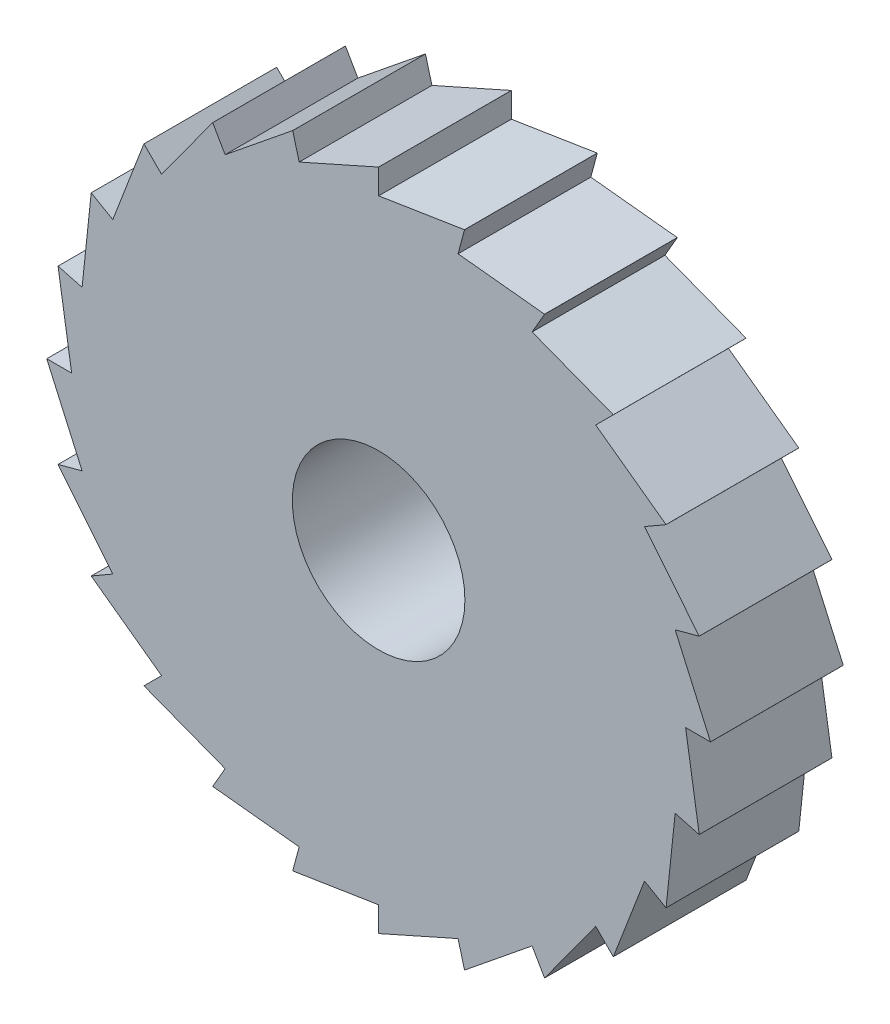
ISO-10303-21;
HEADER;
FILE_DESCRIPTION(('STEP AP214'),'2;1');
FILE_NAME('part.step','',(''),(''),'','','');
FILE_SCHEMA(('AUTOMOTIVE_DESIGN { 1 0 10303 214 1 1 1 1 }'));
ENDSEC;
DATA;
#1=APPLICATION_CONTEXT('core data for automotive mechanical design processes');
#2=APPLICATION_PROTOCOL_DEFINITION('international standard','automotive_design',2000,#1);
#3=PRODUCT_CONTEXT('',#1,'mechanical');
#4=PRODUCT('Part','Part','',(#3));
#5=PRODUCT_RELATED_PRODUCT_CATEGORY('part','',(#4));
#6=PRODUCT_DEFINITION_FORMATION('','',#4);
#7=PRODUCT_DEFINITION_CONTEXT('part definition',#1,'design');
#8=PRODUCT_DEFINITION('design','',#6,#7);
#9=PRODUCT_DEFINITION_SHAPE('','',#8);
#10=(LENGTH_UNIT() NAMED_UNIT(*) SI_UNIT(.MILLI.,.METRE.));
#11=(NAMED_UNIT(*) PLANE_ANGLE_UNIT() SI_UNIT($,.RADIAN.));
#12=(NAMED_UNIT(*) SI_UNIT($,.STERADIAN.) SOLID_ANGLE_UNIT());
#13=UNCERTAINTY_MEASURE_WITH_UNIT(LENGTH_MEASURE(1.E-05),#10,'distance_accuracy_value','');
#14=(GEOMETRIC_REPRESENTATION_CONTEXT(3) GLOBAL_UNCERTAINTY_ASSIGNED_CONTEXT((#13)) GLOBAL_UNIT_ASSIGNED_CONTEXT((#10,
#11,#12)) REPRESENTATION_CONTEXT('',''));
#15=CARTESIAN_POINT('',(0.,0.,0.));
#16=DIRECTION('',(0.,0.,1.));
#17=DIRECTION('',(1.,0.,0.));
#18=AXIS2_PLACEMENT_3D('',#15,#16,#17);
#19=CARTESIAN_POINT('',(0.,0.,10.));
#20=DIRECTION('',(0.,0.,1.));
#21=DIRECTION('',(1.,0.,0.));
#22=AXIS2_PLACEMENT_3D('',#19,#20,#21);
#23=PLANE('',#22);
#24=CARTESIAN_POINT('',(0.,0.,10.));
#25=DIRECTION('',(0.,0.,1.));
#26=DIRECTION('',(1.,0.,0.));
#27=AXIS2_PLACEMENT_3D('',#24,#25,#26);
#28=CIRCLE('',#27,25.);
#29=CARTESIAN_POINT('',(0.,25.,10.));
#30=VERTEX_POINT('',#29);
#31=CARTESIAN_POINT('',(-0.00407324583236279,24.9999996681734,10.));
#32=VERTEX_POINT('',#31);
#33=EDGE_CURVE('E655',#30,#32,#28,.T.);
#34=ORIENTED_EDGE('',*,*,#33,.T.);
#35=DIRECTION('',(-0.913545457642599,-0.406736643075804,0.));
#36=VECTOR('',#35,1.);
#37=CARTESIAN_POINT('',(-5.98519041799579,22.3370347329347,10.));
#38=LINE('',#37,#36);
#39=CARTESIAN_POINT('',(-5.98519041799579,22.3370347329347,10.));
#40=VERTEX_POINT('',#39);
#41=EDGE_CURVE('E283',#32,#40,#38,.T.);
#42=ORIENTED_EDGE('',*,*,#41,.T.);
#43=DIRECTION('',(-0.25881904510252,0.965925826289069,0.));
#44=VECTOR('',#43,1.);
#45=CARTESIAN_POINT('',(-6.47047612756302,24.1481456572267,10.));
#46=LINE('',#45,#44);
#47=CARTESIAN_POINT('',(-6.47047612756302,24.1481456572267,10.));
#48=VERTEX_POINT('',#47);
#49=EDGE_CURVE('E862',#40,#48,#46,.T.);
#50=ORIENTED_EDGE('',*,*,#49,.T.);
#51=CARTESIAN_POINT('',(0.,0.,10.));
#52=DIRECTION('',(0.,0.,1.));
#53=DIRECTION('',(1.,0.,0.));
#54=AXIS2_PLACEMENT_3D('',#51,#52,#53);
#55=CIRCLE('',#54,25.);
#56=CARTESIAN_POINT('',(-6.47441049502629,24.14709110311,10.));
#57=VERTEX_POINT('',#56);
#58=EDGE_CURVE('E881',#48,#57,#55,.T.);
#59=ORIENTED_EDGE('',*,*,#58,.T.);
#60=DIRECTION('',(-0.777145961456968,-0.629320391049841,0.));
#61=VECTOR('',#60,1.);
#62=CARTESIAN_POINT('',(-11.5625,20.0268374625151,10.));
#63=LINE('',#62,#61);
#64=CARTESIAN_POINT('',(-11.5625,20.0268374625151,10.));
#65=VERTEX_POINT('',#64);
#66=EDGE_CURVE('E878',#57,#65,#63,.T.);
#67=ORIENTED_EDGE('',*,*,#66,.T.);
#68=DIRECTION('',(-0.499999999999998,0.86602540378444,0.));
#69=VECTOR('',#68,1.);
#70=CARTESIAN_POINT('',(-12.5,21.6506350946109,10.));
#71=LINE('',#70,#69);
#72=CARTESIAN_POINT('',(-12.5,21.6506350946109,10.));
#73=VERTEX_POINT('',#72);
#74=EDGE_CURVE('E880',#65,#73,#71,.T.);
#75=ORIENTED_EDGE('',*,*,#74,.T.);
#76=CARTESIAN_POINT('',(0.,0.,10.));
#77=DIRECTION('',(0.,0.,1.));
#78=DIRECTION('',(1.,0.,0.));
#79=AXIS2_PLACEMENT_3D('',#76,#77,#78);
#80=CIRCLE('',#79,25.);
#81=CARTESIAN_POINT('',(-12.5035273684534,21.6485981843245,10.));
#82=VERTEX_POINT('',#81);
#83=EDGE_CURVE('E883',#73,#82,#80,.T.);
#84=ORIENTED_EDGE('',*,*,#83,.T.);
#85=DIRECTION('',(-0.58778525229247,-0.80901699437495,0.));
#86=VECTOR('',#85,1.);
#87=CARTESIAN_POINT('',(-16.3518443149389,16.3518443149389,10.));
#88=LINE('',#87,#86);
#89=CARTESIAN_POINT('',(-16.3518443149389,16.3518443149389,10.));
#90=VERTEX_POINT('',#89);
#91=EDGE_CURVE('E889',#82,#90,#88,.T.);
#92=ORIENTED_EDGE('',*,*,#91,.T.);
#93=DIRECTION('',(-0.707106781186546,0.707106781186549,0.));
#94=VECTOR('',#93,1.);
#95=CARTESIAN_POINT('',(-17.6776695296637,17.6776695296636,10.));
#96=LINE('',#95,#94);
#97=CARTESIAN_POINT('',(-17.6776695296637,17.6776695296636,10.));
#98=VERTEX_POINT('',#97);
#99=EDGE_CURVE('E891',#90,#98,#96,.T.);
#100=ORIENTED_EDGE('',*,*,#99,.T.);
#101=CARTESIAN_POINT('',(0.,0.,10.));
#102=DIRECTION('',(0.,0.,1.));
#103=DIRECTION('',(1.,0.,0.));
#104=AXIS2_PLACEMENT_3D('',#101,#102,#103);
#105=CIRCLE('',#104,25.);
#106=CARTESIAN_POINT('',(-17.6805495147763,17.6747890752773,10.));
#107=VERTEX_POINT('',#106);
#108=EDGE_CURVE('E893',#98,#107,#105,.T.);
#109=ORIENTED_EDGE('',*,*,#108,.T.);
#110=DIRECTION('',(-0.358367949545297,-0.933580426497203,0.));
#111=VECTOR('',#110,1.);
#112=CARTESIAN_POINT('',(-20.0268374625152,11.5625,10.));
#113=LINE('',#112,#111);
#114=CARTESIAN_POINT('',(-20.0268374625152,11.5625,10.));
#115=VERTEX_POINT('',#114);
#116=EDGE_CURVE('E895',#107,#115,#113,.T.);
#117=ORIENTED_EDGE('',*,*,#116,.T.);
#118=DIRECTION('',(-0.866025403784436,0.500000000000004,0.));
#119=VECTOR('',#118,1.);
#120=CARTESIAN_POINT('',(-21.650635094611,12.5,10.));
#121=LINE('',#120,#119);
#122=CARTESIAN_POINT('',(-21.650635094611,12.5,10.));
#123=VERTEX_POINT('',#122);
#124=EDGE_CURVE('E897',#115,#123,#121,.T.);
#125=ORIENTED_EDGE('',*,*,#124,.T.);
#126=CARTESIAN_POINT('',(0.,0.,10.));
#127=DIRECTION('',(0.,0.,1.));
#128=DIRECTION('',(1.,0.,0.));
#129=AXIS2_PLACEMENT_3D('',#126,#127,#128);
#130=CIRCLE('',#129,25.);
#131=CARTESIAN_POINT('',(-21.6526714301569,12.49647229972,10.));
#132=VERTEX_POINT('',#131);
#133=EDGE_CURVE('E899',#123,#132,#130,.T.);
#134=ORIENTED_EDGE('',*,*,#133,.T.);
#135=DIRECTION('',(-0.104528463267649,-0.994521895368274,0.));
#136=VECTOR('',#135,1.);
#137=CARTESIAN_POINT('',(-22.3370347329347,5.98519041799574,10.));
#138=LINE('',#137,#136);
#139=CARTESIAN_POINT('',(-22.3370347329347,5.98519041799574,10.));
#140=VERTEX_POINT('',#139);
#141=EDGE_CURVE('E901',#132,#140,#138,.T.);
#142=ORIENTED_EDGE('',*,*,#141,.T.);
#143=DIRECTION('',(-0.965925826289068,0.258819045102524,0.));
#144=VECTOR('',#143,1.);
#145=CARTESIAN_POINT('',(-24.1481456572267,6.47047612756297,10.));
#146=LINE('',#145,#144);
#147=CARTESIAN_POINT('',(-24.1481456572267,6.47047612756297,10.));
#148=VERTEX_POINT('',#147);
#149=EDGE_CURVE('E903',#140,#148,#146,.T.);
#150=ORIENTED_EDGE('',*,*,#149,.T.);
#151=CARTESIAN_POINT('',(0.,0.,10.));
#152=DIRECTION('',(0.,0.,1.));
#153=DIRECTION('',(1.,0.,0.));
#154=AXIS2_PLACEMENT_3D('',#151,#152,#153);
#155=CIRCLE('',#154,25.);
#156=CARTESIAN_POINT('',(-24.1491995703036,6.46654158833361,10.));
#157=VERTEX_POINT('',#156);
#158=EDGE_CURVE('E905',#148,#157,#155,.T.);
#159=ORIENTED_EDGE('',*,*,#158,.T.);
#160=DIRECTION('',(0.156434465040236,-0.987688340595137,0.));
#161=VECTOR('',#160,1.);
#162=CARTESIAN_POINT('',(-23.125,0.,10.));
#163=LINE('',#162,#161);
#164=CARTESIAN_POINT('',(-23.125,0.,10.));
#165=VERTEX_POINT('',#164);
#166=EDGE_CURVE('E907',#157,#165,#163,.T.);
#167=ORIENTED_EDGE('',*,*,#166,.T.);
#168=DIRECTION('',(-1.,0.,0.));
#169=VECTOR('',#168,1.);
#170=CARTESIAN_POINT('',(-25.,0.,10.));
#171=LINE('',#170,#169);
#172=CARTESIAN_POINT('',(-25.,0.,10.));
#173=VERTEX_POINT('',#172);
#174=EDGE_CURVE('E909',#165,#173,#171,.T.);
#175=ORIENTED_EDGE('',*,*,#174,.T.);
#176=CARTESIAN_POINT('',(0.,0.,10.));
#177=DIRECTION('',(0.,0.,1.));
#178=DIRECTION('',(1.,0.,0.));
#179=AXIS2_PLACEMENT_3D('',#176,#177,#178);
#180=CIRCLE('',#179,25.);
#181=CARTESIAN_POINT('',(-24.9999996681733,-0.00407324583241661,10.));
#182=VERTEX_POINT('',#181);
#183=EDGE_CURVE('E911',#173,#182,#180,.T.);
#184=ORIENTED_EDGE('',*,*,#183,.T.);
#185=DIRECTION('',(0.406736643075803,-0.9135454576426,0.));
#186=VECTOR('',#185,1.);
#187=CARTESIAN_POINT('',(-22.3370347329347,-5.98519041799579,10.));
#188=LINE('',#187,#186);
#189=CARTESIAN_POINT('',(-22.3370347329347,-5.98519041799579,10.));
#190=VERTEX_POINT('',#189);
#191=EDGE_CURVE('E913',#182,#190,#188,.T.);
#192=ORIENTED_EDGE('',*,*,#191,.T.);
#193=DIRECTION('',(-0.965925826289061,-0.258819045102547,0.));
#194=VECTOR('',#193,1.);
#195=CARTESIAN_POINT('',(-24.1481456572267,-6.47047612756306,10.));
#196=LINE('',#195,#194);
#197=CARTESIAN_POINT('',(-24.1481456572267,-6.47047612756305,10.));
#198=VERTEX_POINT('',#197);
#199=EDGE_CURVE('E915',#190,#198,#196,.T.);
#200=ORIENTED_EDGE('',*,*,#199,.T.);
#201=CARTESIAN_POINT('',(0.,0.,10.));
#202=DIRECTION('',(0.,0.,1.));
#203=DIRECTION('',(1.,0.,0.));
#204=AXIS2_PLACEMENT_3D('',#201,#202,#203);
#205=CIRCLE('',#204,25.);
#206=CARTESIAN_POINT('',(-24.14709110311,-6.47441049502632,10.));
#207=VERTEX_POINT('',#206);
#208=EDGE_CURVE('E917',#198,#207,#205,.T.);
#209=ORIENTED_EDGE('',*,*,#208,.T.);
#210=DIRECTION('',(0.62932039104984,-0.777145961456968,0.));
#211=VECTOR('',#210,1.);
#212=CARTESIAN_POINT('',(-20.0268374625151,-11.5625,10.));
#213=LINE('',#212,#211);
#214=CARTESIAN_POINT('',(-20.0268374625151,-11.5625,10.));
#215=VERTEX_POINT('',#214);
#216=EDGE_CURVE('E919',#207,#215,#213,.T.);
#217=ORIENTED_EDGE('',*,*,#216,.T.);
#218=DIRECTION('',(-0.866025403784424,-0.500000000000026,0.));
#219=VECTOR('',#218,1.);
#220=CARTESIAN_POINT('',(-21.6506350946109,-12.5,10.));
#221=LINE('',#220,#219);
#222=CARTESIAN_POINT('',(-21.6506350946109,-12.5,10.));
#223=VERTEX_POINT('',#222);
#224=EDGE_CURVE('E921',#215,#223,#221,.T.);
#225=ORIENTED_EDGE('',*,*,#224,.T.);
#226=CARTESIAN_POINT('',(0.,0.,10.));
#227=DIRECTION('',(0.,0.,1.));
#228=DIRECTION('',(1.,0.,0.));
#229=AXIS2_PLACEMENT_3D('',#226,#227,#228);
#230=CIRCLE('',#229,25.);
#231=CARTESIAN_POINT('',(-21.6485981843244,-12.5035273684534,10.));
#232=VERTEX_POINT('',#231);
#233=EDGE_CURVE('E923',#223,#232,#230,.T.);
#234=ORIENTED_EDGE('',*,*,#233,.T.);
#235=DIRECTION('',(0.80901699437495,-0.587785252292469,0.));
#236=VECTOR('',#235,1.);
#237=CARTESIAN_POINT('',(-16.3518443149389,-16.3518443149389,10.));
#238=LINE('',#237,#236);
#239=CARTESIAN_POINT('',(-16.3518443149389,-16.3518443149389,10.));
#240=VERTEX_POINT('',#239);
#241=EDGE_CURVE('E925',#232,#240,#238,.T.);
#242=ORIENTED_EDGE('',*,*,#241,.T.);
#243=DIRECTION('',(-0.707106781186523,-0.707106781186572,0.));
#244=VECTOR('',#243,1.);
#245=CARTESIAN_POINT('',(-17.6776695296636,-17.6776695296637,10.));
#246=LINE('',#245,#244);
#247=CARTESIAN_POINT('',(-17.6776695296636,-17.6776695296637,10.));
#248=VERTEX_POINT('',#247);
#249=EDGE_CURVE('E927',#240,#248,#246,.T.);
#250=ORIENTED_EDGE('',*,*,#249,.T.);
#251=CARTESIAN_POINT('',(0.,0.,10.));
#252=DIRECTION('',(0.,0.,1.));
#253=DIRECTION('',(1.,0.,0.));
#254=AXIS2_PLACEMENT_3D('',#251,#252,#253);
#255=CIRCLE('',#254,25.);
#256=CARTESIAN_POINT('',(-17.6747890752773,-17.6805495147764,10.));
#257=VERTEX_POINT('',#256);
#258=EDGE_CURVE('E929',#248,#257,#255,.T.);
#259=ORIENTED_EDGE('',*,*,#258,.T.);
#260=DIRECTION('',(0.933580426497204,-0.358367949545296,0.));
#261=VECTOR('',#260,1.);
#262=CARTESIAN_POINT('',(-11.5625,-20.0268374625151,10.));
#263=LINE('',#262,#261);
#264=CARTESIAN_POINT('',(-11.5625,-20.0268374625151,10.));
#265=VERTEX_POINT('',#264);
#266=EDGE_CURVE('E931',#257,#265,#263,.T.);
#267=ORIENTED_EDGE('',*,*,#266,.T.);
#268=DIRECTION('',(-0.499999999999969,-0.866025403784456,0.));
#269=VECTOR('',#268,1.);
#270=CARTESIAN_POINT('',(-12.4999999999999,-21.650635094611,10.));
#271=LINE('',#270,#269);
#272=CARTESIAN_POINT('',(-12.4999999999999,-21.650635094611,10.));
#273=VERTEX_POINT('',#272);
#274=EDGE_CURVE('E933',#265,#273,#271,.T.);
#275=ORIENTED_EDGE('',*,*,#274,.T.);
#276=CARTESIAN_POINT('',(0.,0.,10.));
#277=DIRECTION('',(0.,0.,1.));
#278=DIRECTION('',(1.,0.,0.));
#279=AXIS2_PLACEMENT_3D('',#276,#277,#278);
#280=CIRCLE('',#279,25.);
#281=CARTESIAN_POINT('',(-12.4964722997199,-21.6526714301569,10.));
#282=VERTEX_POINT('',#281);
#283=EDGE_CURVE('E935',#273,#282,#280,.T.);
#284=ORIENTED_EDGE('',*,*,#283,.T.);
#285=DIRECTION('',(0.994521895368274,-0.104528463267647,0.));
#286=VECTOR('',#285,1.);
#287=CARTESIAN_POINT('',(-5.98519041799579,-22.3370347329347,10.));
#288=LINE('',#287,#286);
#289=CARTESIAN_POINT('',(-5.98519041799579,-22.3370347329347,10.));
#290=VERTEX_POINT('',#289);
#291=EDGE_CURVE('E937',#282,#290,#288,.T.);
#292=ORIENTED_EDGE('',*,*,#291,.T.);
#293=DIRECTION('',(-0.258819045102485,-0.965925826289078,0.));
#294=VECTOR('',#293,1.);
#295=CARTESIAN_POINT('',(-6.47047612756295,-24.1481456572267,10.));
#296=LINE('',#295,#294);
#297=CARTESIAN_POINT('',(-6.47047612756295,-24.1481456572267,10.));
#298=VERTEX_POINT('',#297);
#299=EDGE_CURVE('E939',#290,#298,#296,.T.);
#300=ORIENTED_EDGE('',*,*,#299,.T.);
#301=CARTESIAN_POINT('',(0.,0.,10.));
#302=DIRECTION('',(0.,0.,1.));
#303=DIRECTION('',(1.,0.,0.));
#304=AXIS2_PLACEMENT_3D('',#301,#302,#303);
#305=CIRCLE('',#304,25.);
#306=CARTESIAN_POINT('',(-6.46654158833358,-24.1491995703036,10.));
#307=VERTEX_POINT('',#306);
#308=EDGE_CURVE('E941',#298,#307,#305,.T.);
#309=ORIENTED_EDGE('',*,*,#308,.T.);
#310=DIRECTION('',(0.987688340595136,0.156434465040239,0.));
#311=VECTOR('',#310,1.);
#312=CARTESIAN_POINT('',(0.,-23.125,10.));
#313=LINE('',#312,#311);
#314=CARTESIAN_POINT('',(0.,-23.125,10.));
#315=VERTEX_POINT('',#314);
#316=EDGE_CURVE('E943',#307,#315,#313,.T.);
#317=ORIENTED_EDGE('',*,*,#316,.T.);
#318=DIRECTION('',(0.,-1.,0.));
#319=VECTOR('',#318,1.);
#320=CARTESIAN_POINT('',(0.,-25.,10.));
#321=LINE('',#320,#319);
#322=CARTESIAN_POINT('',(0.,-25.,10.));
#323=VERTEX_POINT('',#322);
#324=EDGE_CURVE('E945',#315,#323,#321,.T.);
#325=ORIENTED_EDGE('',*,*,#324,.T.);
#326=CARTESIAN_POINT('',(0.,0.,10.));
#327=DIRECTION('',(0.,0.,1.));
#328=DIRECTION('',(1.,0.,0.));
#329=AXIS2_PLACEMENT_3D('',#326,#327,#328);
#330=CIRCLE('',#329,25.);
#331=CARTESIAN_POINT('',(0.00407324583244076,-24.9999996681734,10.));
#332=VERTEX_POINT('',#331);
#333=EDGE_CURVE('E947',#323,#332,#330,.T.);
#334=ORIENTED_EDGE('',*,*,#333,.T.);
#335=DIRECTION('',(0.913545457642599,0.406736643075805,0.));
#336=VECTOR('',#335,1.);
#337=CARTESIAN_POINT('',(5.98519041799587,-22.3370347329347,10.));
#338=LINE('',#337,#336);
#339=CARTESIAN_POINT('',(5.98519041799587,-22.3370347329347,10.));
#340=VERTEX_POINT('',#339);
#341=EDGE_CURVE('E949',#332,#340,#338,.T.);
#342=ORIENTED_EDGE('',*,*,#341,.T.);
#343=DIRECTION('',(0.258819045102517,-0.96592582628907,0.));
#344=VECTOR('',#343,1.);
#345=CARTESIAN_POINT('',(6.47047612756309,-24.1481456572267,10.));
#346=LINE('',#345,#344);
#347=CARTESIAN_POINT('',(6.47047612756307,-24.1481456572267,10.));
#348=VERTEX_POINT('',#347);
#349=EDGE_CURVE('E951',#340,#348,#346,.T.);
#350=ORIENTED_EDGE('',*,*,#349,.T.);
#351=CARTESIAN_POINT('',(0.,0.,10.));
#352=DIRECTION('',(0.,0.,1.));
#353=DIRECTION('',(1.,0.,0.));
#354=AXIS2_PLACEMENT_3D('',#351,#352,#353);
#355=CIRCLE('',#354,25.);
#356=CARTESIAN_POINT('',(6.47441049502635,-24.14709110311,10.));
#357=VERTEX_POINT('',#356);
#358=EDGE_CURVE('E953',#348,#357,#355,.T.);
#359=ORIENTED_EDGE('',*,*,#358,.T.);
#360=DIRECTION('',(0.777145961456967,0.629320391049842,0.));
#361=VECTOR('',#360,1.);
#362=CARTESIAN_POINT('',(11.5625000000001,-20.0268374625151,10.));
#363=LINE('',#362,#361);
#364=CARTESIAN_POINT('',(11.5625000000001,-20.0268374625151,10.));
#365=VERTEX_POINT('',#364);
#366=EDGE_CURVE('E955',#357,#365,#363,.T.);
#367=ORIENTED_EDGE('',*,*,#366,.T.);
#368=DIRECTION('',(0.499999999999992,-0.866025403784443,0.));
#369=VECTOR('',#368,1.);
#370=CARTESIAN_POINT('',(12.5000000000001,-21.6506350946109,10.));
#371=LINE('',#370,#369);
#372=CARTESIAN_POINT('',(12.5000000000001,-21.6506350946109,10.));
#373=VERTEX_POINT('',#372);
#374=EDGE_CURVE('E957',#365,#373,#371,.T.);
#375=ORIENTED_EDGE('',*,*,#374,.T.);
#376=CARTESIAN_POINT('',(0.,0.,10.));
#377=DIRECTION('',(0.,0.,1.));
#378=DIRECTION('',(1.,0.,0.));
#379=AXIS2_PLACEMENT_3D('',#376,#377,#378);
#380=CIRCLE('',#379,25.);
#381=CARTESIAN_POINT('',(12.5035273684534,-21.6485981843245,10.));
#382=VERTEX_POINT('',#381);
#383=EDGE_CURVE('E959',#373,#382,#380,.T.);
#384=ORIENTED_EDGE('',*,*,#383,.T.);
#385=DIRECTION('',(0.587785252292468,0.809016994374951,0.));
#386=VECTOR('',#385,1.);
#387=CARTESIAN_POINT('',(16.351844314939,-16.3518443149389,10.));
#388=LINE('',#387,#386);
#389=CARTESIAN_POINT('',(16.351844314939,-16.3518443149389,10.));
#390=VERTEX_POINT('',#389);
#391=EDGE_CURVE('E961',#382,#390,#388,.T.);
#392=ORIENTED_EDGE('',*,*,#391,.T.);
#393=DIRECTION('',(0.707106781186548,-0.707106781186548,0.));
#394=VECTOR('',#393,1.);
#395=CARTESIAN_POINT('',(17.6776695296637,-17.6776695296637,10.));
#396=LINE('',#395,#394);
#397=CARTESIAN_POINT('',(17.6776695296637,-17.6776695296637,10.));
#398=VERTEX_POINT('',#397);
#399=EDGE_CURVE('E963',#390,#398,#396,.T.);
#400=ORIENTED_EDGE('',*,*,#399,.T.);
#401=CARTESIAN_POINT('',(0.,0.,10.));
#402=DIRECTION('',(0.,0.,1.));
#403=DIRECTION('',(1.,0.,0.));
#404=AXIS2_PLACEMENT_3D('',#401,#402,#403);
#405=CIRCLE('',#404,25.);
#406=CARTESIAN_POINT('',(17.6805495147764,-17.6747890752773,10.));
#407=VERTEX_POINT('',#406);
#408=EDGE_CURVE('E965',#398,#407,#405,.T.);
#409=ORIENTED_EDGE('',*,*,#408,.T.);
#410=DIRECTION('',(0.358367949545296,0.933580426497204,0.));
#411=VECTOR('',#410,1.);
#412=CARTESIAN_POINT('',(20.0268374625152,-11.5625,10.));
#413=LINE('',#412,#411);
#414=CARTESIAN_POINT('',(20.0268374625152,-11.5625,10.));
#415=VERTEX_POINT('',#414);
#416=EDGE_CURVE('E967',#407,#415,#413,.T.);
#417=ORIENTED_EDGE('',*,*,#416,.T.);
#418=DIRECTION('',(0.866025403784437,-0.500000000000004,0.));
#419=VECTOR('',#418,1.);
#420=CARTESIAN_POINT('',(21.650635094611,-12.5,10.));
#421=LINE('',#420,#419);
#422=CARTESIAN_POINT('',(21.650635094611,-12.5,10.));
#423=VERTEX_POINT('',#422);
#424=EDGE_CURVE('E969',#415,#423,#421,.T.);
#425=ORIENTED_EDGE('',*,*,#424,.T.);
#426=CARTESIAN_POINT('',(0.,0.,10.));
#427=DIRECTION('',(0.,0.,1.));
#428=DIRECTION('',(1.,0.,0.));
#429=AXIS2_PLACEMENT_3D('',#426,#427,#428);
#430=CIRCLE('',#429,25.);
#431=CARTESIAN_POINT('',(21.6526714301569,-12.49647229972,10.));
#432=VERTEX_POINT('',#431);
#433=EDGE_CURVE('E971',#423,#432,#430,.T.);
#434=ORIENTED_EDGE('',*,*,#433,.T.);
#435=DIRECTION('',(0.104528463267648,0.994521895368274,0.));
#436=VECTOR('',#435,1.);
#437=CARTESIAN_POINT('',(22.3370347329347,-5.98519041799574,10.));
#438=LINE('',#437,#436);
#439=CARTESIAN_POINT('',(22.3370347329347,-5.98519041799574,10.));
#440=VERTEX_POINT('',#439);
#441=EDGE_CURVE('E973',#432,#440,#438,.T.);
#442=ORIENTED_EDGE('',*,*,#441,.T.);
#443=DIRECTION('',(0.965925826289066,-0.258819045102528,0.));
#444=VECTOR('',#443,1.);
#445=CARTESIAN_POINT('',(24.1481456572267,-6.47047612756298,10.));
#446=LINE('',#445,#444);
#447=CARTESIAN_POINT('',(24.1481456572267,-6.47047612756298,10.));
#448=VERTEX_POINT('',#447);
#449=EDGE_CURVE('E975',#440,#448,#446,.T.);
#450=ORIENTED_EDGE('',*,*,#449,.T.);
#451=CARTESIAN_POINT('',(0.,0.,10.));
#452=DIRECTION('',(0.,0.,1.));
#453=DIRECTION('',(1.,0.,0.));
#454=AXIS2_PLACEMENT_3D('',#451,#452,#453);
#455=CIRCLE('',#454,25.);
#456=CARTESIAN_POINT('',(24.1491995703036,-6.46654158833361,10.));
#457=VERTEX_POINT('',#456);
#458=EDGE_CURVE('E977',#448,#457,#455,.T.);
#459=ORIENTED_EDGE('',*,*,#458,.T.);
#460=DIRECTION('',(-0.156434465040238,0.987688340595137,0.));
#461=VECTOR('',#460,1.);
#462=CARTESIAN_POINT('',(23.125,0.,10.));
#463=LINE('',#462,#461);
#464=CARTESIAN_POINT('',(23.125,0.,10.));
#465=VERTEX_POINT('',#464);
#466=EDGE_CURVE('E979',#457,#465,#463,.T.);
#467=ORIENTED_EDGE('',*,*,#466,.T.);
#468=DIRECTION('',(1.,0.,0.));
#469=VECTOR('',#468,1.);
#470=CARTESIAN_POINT('',(25.,0.,10.));
#471=LINE('',#470,#469);
#472=CARTESIAN_POINT('',(25.,0.,10.));
#473=VERTEX_POINT('',#472);
#474=EDGE_CURVE('E981',#465,#473,#471,.T.);
#475=ORIENTED_EDGE('',*,*,#474,.T.);
#476=CARTESIAN_POINT('',(0.,0.,10.));
#477=DIRECTION('',(0.,0.,1.));
#478=DIRECTION('',(1.,0.,0.));
#479=AXIS2_PLACEMENT_3D('',#476,#477,#478);
#480=CIRCLE('',#479,25.);
#481=CARTESIAN_POINT('',(24.9999996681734,0.0040732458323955,10.));
#482=VERTEX_POINT('',#481);
#483=EDGE_CURVE('E983',#473,#482,#480,.T.);
#484=ORIENTED_EDGE('',*,*,#483,.T.);
#485=DIRECTION('',(-0.406736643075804,0.913545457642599,0.));
#486=VECTOR('',#485,1.);
#487=CARTESIAN_POINT('',(22.3370347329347,5.98519041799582,10.));
#488=LINE('',#487,#486);
#489=CARTESIAN_POINT('',(22.3370347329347,5.98519041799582,10.));
#490=VERTEX_POINT('',#489);
#491=EDGE_CURVE('E985',#482,#490,#488,.T.);
#492=ORIENTED_EDGE('',*,*,#491,.T.);
#493=DIRECTION('',(0.965925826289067,0.258819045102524,0.));
#494=VECTOR('',#493,1.);
#495=CARTESIAN_POINT('',(24.1481456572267,6.47047612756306,10.));
#496=LINE('',#495,#494);
#497=CARTESIAN_POINT('',(24.1481456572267,6.47047612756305,10.));
#498=VERTEX_POINT('',#497);
#499=EDGE_CURVE('E987',#490,#498,#496,.T.);
#500=ORIENTED_EDGE('',*,*,#499,.T.);
#501=CARTESIAN_POINT('',(0.,0.,10.));
#502=DIRECTION('',(0.,0.,1.));
#503=DIRECTION('',(1.,0.,0.));
#504=AXIS2_PLACEMENT_3D('',#501,#502,#503);
#505=CIRCLE('',#504,25.);
#506=CARTESIAN_POINT('',(24.14709110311,6.4744104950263,10.));
#507=VERTEX_POINT('',#506);
#508=EDGE_CURVE('E989',#498,#507,#505,.T.);
#509=ORIENTED_EDGE('',*,*,#508,.T.);
#510=DIRECTION('',(-0.629320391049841,0.777145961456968,0.));
#511=VECTOR('',#510,1.);
#512=CARTESIAN_POINT('',(20.0268374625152,11.5625,10.));
#513=LINE('',#512,#511);
#514=CARTESIAN_POINT('',(20.0268374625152,11.5625,10.));
#515=VERTEX_POINT('',#514);
#516=EDGE_CURVE('E991',#507,#515,#513,.T.);
#517=ORIENTED_EDGE('',*,*,#516,.T.);
#518=DIRECTION('',(0.866025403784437,0.500000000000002,0.));
#519=VECTOR('',#518,1.);
#520=CARTESIAN_POINT('',(21.650635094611,12.5,10.));
#521=LINE('',#520,#519);
#522=CARTESIAN_POINT('',(21.650635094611,12.5,10.));
#523=VERTEX_POINT('',#522);
#524=EDGE_CURVE('E993',#515,#523,#521,.T.);
#525=ORIENTED_EDGE('',*,*,#524,.T.);
#526=CARTESIAN_POINT('',(0.,0.,10.));
#527=DIRECTION('',(0.,0.,1.));
#528=DIRECTION('',(1.,0.,0.));
#529=AXIS2_PLACEMENT_3D('',#526,#527,#528);
#530=CIRCLE('',#529,25.);
#531=CARTESIAN_POINT('',(21.6485981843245,12.5035273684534,10.));
#532=VERTEX_POINT('',#531);
#533=EDGE_CURVE('E995',#523,#532,#530,.T.);
#534=ORIENTED_EDGE('',*,*,#533,.T.);
#535=DIRECTION('',(-0.80901699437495,0.587785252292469,0.));
#536=VECTOR('',#535,1.);
#537=CARTESIAN_POINT('',(16.3518443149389,16.3518443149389,10.));
#538=LINE('',#537,#536);
#539=CARTESIAN_POINT('',(16.3518443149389,16.3518443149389,10.));
#540=VERTEX_POINT('',#539);
#541=EDGE_CURVE('E997',#532,#540,#538,.T.);
#542=ORIENTED_EDGE('',*,*,#541,.T.);
#543=DIRECTION('',(0.707106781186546,0.707106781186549,0.));
#544=VECTOR('',#543,1.);
#545=CARTESIAN_POINT('',(17.6776695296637,17.6776695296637,10.));
#546=LINE('',#545,#544);
#547=CARTESIAN_POINT('',(17.6776695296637,17.6776695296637,10.));
#548=VERTEX_POINT('',#547);
#549=EDGE_CURVE('E999',#540,#548,#546,.T.);
#550=ORIENTED_EDGE('',*,*,#549,.T.);
#551=CARTESIAN_POINT('',(0.,0.,10.));
#552=DIRECTION('',(0.,0.,1.));
#553=DIRECTION('',(1.,0.,0.));
#554=AXIS2_PLACEMENT_3D('',#551,#552,#553);
#555=CIRCLE('',#554,25.);
#556=CARTESIAN_POINT('',(17.6747890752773,17.6805495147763,10.));
#557=VERTEX_POINT('',#556);
#558=EDGE_CURVE('E1001',#548,#557,#555,.T.);
#559=ORIENTED_EDGE('',*,*,#558,.T.);
#560=DIRECTION('',(-0.933580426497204,0.358367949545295,0.));
#561=VECTOR('',#560,1.);
#562=CARTESIAN_POINT('',(11.5625,20.0268374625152,10.));
#563=LINE('',#562,#561);
#564=CARTESIAN_POINT('',(11.5625,20.0268374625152,10.));
#565=VERTEX_POINT('',#564);
#566=EDGE_CURVE('E1003',#557,#565,#563,.T.);
#567=ORIENTED_EDGE('',*,*,#566,.T.);
#568=DIRECTION('',(0.499999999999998,0.86602540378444,0.));
#569=VECTOR('',#568,1.);
#570=CARTESIAN_POINT('',(12.5,21.650635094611,10.));
#571=LINE('',#570,#569);
#572=CARTESIAN_POINT('',(12.5,21.650635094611,10.));
#573=VERTEX_POINT('',#572);
#574=EDGE_CURVE('E1005',#565,#573,#571,.T.);
#575=ORIENTED_EDGE('',*,*,#574,.T.);
#576=CARTESIAN_POINT('',(0.,0.,10.));
#577=DIRECTION('',(0.,0.,1.));
#578=DIRECTION('',(1.,0.,0.));
#579=AXIS2_PLACEMENT_3D('',#576,#577,#578);
#580=CIRCLE('',#579,25.);
#581=CARTESIAN_POINT('',(12.49647229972,21.6526714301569,10.));
#582=VERTEX_POINT('',#581);
#583=EDGE_CURVE('E1007',#573,#582,#580,.T.);
#584=ORIENTED_EDGE('',*,*,#583,.T.);
#585=DIRECTION('',(-0.994521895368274,0.104528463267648,0.));
#586=VECTOR('',#585,1.);
#587=CARTESIAN_POINT('',(5.98519041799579,22.3370347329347,10.));
#588=LINE('',#587,#586);
#589=CARTESIAN_POINT('',(5.98519041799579,22.3370347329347,10.));
#590=VERTEX_POINT('',#589);
#591=EDGE_CURVE('E1009',#582,#590,#588,.T.);
#592=ORIENTED_EDGE('',*,*,#591,.T.);
#593=DIRECTION('',(0.25881904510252,0.965925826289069,0.));
#594=VECTOR('',#593,1.);
#595=CARTESIAN_POINT('',(6.47047612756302,24.1481456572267,10.));
#596=LINE('',#595,#594);
#597=CARTESIAN_POINT('',(6.47047612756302,24.1481456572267,10.));
#598=VERTEX_POINT('',#597);
#599=EDGE_CURVE('E494',#590,#598,#596,.T.);
#600=ORIENTED_EDGE('',*,*,#599,.T.);
#601=CARTESIAN_POINT('',(0.,0.,10.));
#602=DIRECTION('',(0.,0.,1.));
#603=DIRECTION('',(1.,0.,0.));
#604=AXIS2_PLACEMENT_3D('',#601,#602,#603);
#605=CIRCLE('',#604,25.);
#606=CARTESIAN_POINT('',(6.46654158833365,24.1491995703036,10.));
#607=VERTEX_POINT('',#606);
#608=EDGE_CURVE('E488',#598,#607,#605,.T.);
#609=ORIENTED_EDGE('',*,*,#608,.T.);
#610=DIRECTION('',(-0.987688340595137,-0.156434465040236,0.));
#611=VECTOR('',#610,1.);
#612=CARTESIAN_POINT('',(0.,23.125,10.));
#613=LINE('',#612,#611);
#614=CARTESIAN_POINT('',(0.,23.125,10.));
#615=VERTEX_POINT('',#614);
#616=EDGE_CURVE('E492',#607,#615,#613,.T.);
#617=ORIENTED_EDGE('',*,*,#616,.T.);
#618=DIRECTION('',(0.,1.,0.));
#619=VECTOR('',#618,1.);
#620=CARTESIAN_POINT('',(0.,25.,10.));
#621=LINE('',#620,#619);
#622=EDGE_CURVE('E48',#615,#30,#621,.T.);
#623=ORIENTED_EDGE('',*,*,#622,.T.);
#624=EDGE_LOOP('',(#34,#42,#50,#59,#67,#75,#84,#92,#100,#109,#117,#125,#134,#142,#150,#159,#167,
#175,#184,#192,#200,#209,#217,#225,#234,#242,#250,#259,#267,#275,#284,#292,#300,#309,#317,#325,
#334,#342,#350,#359,#367,#375,#384,#392,#400,#409,#417,#425,#434,#442,#450,#459,#467,#475,#484,
#492,#500,#509,#517,#525,#534,#542,#550,#559,#567,#575,#584,#592,#600,#609,#617,#623));
#625=FACE_BOUND('',#624,.T.);
#626=CARTESIAN_POINT('',(0.,0.,10.));
#627=DIRECTION('',(0.,0.,1.));
#628=DIRECTION('',(1.,0.,0.));
#629=AXIS2_PLACEMENT_3D('',#626,#627,#628);
#630=CIRCLE('',#629,6.5);
#631=CARTESIAN_POINT('',(6.5,0.,10.));
#632=VERTEX_POINT('',#631);
#633=EDGE_CURVE('E516',#632,#632,#630,.T.);
#634=ORIENTED_EDGE('',*,*,#633,.F.);
#635=EDGE_LOOP('',(#634));
#636=FACE_BOUND('',#635,.T.);
#637=ADVANCED_FACE('F31',(#625,#636),#23,.T.);
#638=CARTESIAN_POINT('',(0.,0.,0.));
#639=DIRECTION('',(0.,0.,1.));
#640=DIRECTION('',(1.,0.,0.));
#641=AXIS2_PLACEMENT_3D('',#638,#639,#640);
#642=PLANE('',#641);
#643=CARTESIAN_POINT('',(0.,0.,0.));
#644=DIRECTION('',(0.,0.,1.));
#645=DIRECTION('',(1.,0.,0.));
#646=AXIS2_PLACEMENT_3D('',#643,#644,#645);
#647=CIRCLE('',#646,25.);
#648=CARTESIAN_POINT('',(0.,25.,0.));
#649=VERTEX_POINT('',#648);
#650=CARTESIAN_POINT('',(-0.00407324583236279,24.9999996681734,0.));
#651=VERTEX_POINT('',#650);
#652=EDGE_CURVE('E512',#649,#651,#647,.T.);
#653=ORIENTED_EDGE('',*,*,#652,.F.);
#654=DIRECTION('',(0.,1.,0.));
#655=VECTOR('',#654,1.);
#656=CARTESIAN_POINT('',(0.,25.,0.));
#657=LINE('',#656,#655);
#658=CARTESIAN_POINT('',(0.,23.125,0.));
#659=VERTEX_POINT('',#658);
#660=EDGE_CURVE('E275',#659,#649,#657,.T.);
#661=ORIENTED_EDGE('',*,*,#660,.F.);
#662=DIRECTION('',(-0.987688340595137,-0.156434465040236,0.));
#663=VECTOR('',#662,1.);
#664=CARTESIAN_POINT('',(0.,23.125,0.));
#665=LINE('',#664,#663);
#666=CARTESIAN_POINT('',(6.46654158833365,24.1491995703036,0.));
#667=VERTEX_POINT('',#666);
#668=EDGE_CURVE('E269',#667,#659,#665,.T.);
#669=ORIENTED_EDGE('',*,*,#668,.F.);
#670=CARTESIAN_POINT('',(0.,0.,0.));
#671=DIRECTION('',(0.,0.,1.));
#672=DIRECTION('',(1.,0.,0.));
#673=AXIS2_PLACEMENT_3D('',#670,#671,#672);
#674=CIRCLE('',#673,25.);
#675=CARTESIAN_POINT('',(6.47047612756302,24.1481456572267,0.));
#676=VERTEX_POINT('',#675);
#677=EDGE_CURVE('E502',#676,#667,#674,.T.);
#678=ORIENTED_EDGE('',*,*,#677,.F.);
#679=DIRECTION('',(0.25881904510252,0.965925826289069,0.));
#680=VECTOR('',#679,1.);
#681=CARTESIAN_POINT('',(6.47047612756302,24.1481456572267,0.));
#682=LINE('',#681,#680);
#683=CARTESIAN_POINT('',(5.98519041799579,22.3370347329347,0.));
#684=VERTEX_POINT('',#683);
#685=EDGE_CURVE('E650',#684,#676,#682,.T.);
#686=ORIENTED_EDGE('',*,*,#685,.F.);
#687=DIRECTION('',(-0.994521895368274,0.104528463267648,0.));
#688=VECTOR('',#687,1.);
#689=CARTESIAN_POINT('',(5.98519041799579,22.3370347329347,0.));
#690=LINE('',#689,#688);
#691=CARTESIAN_POINT('',(12.49647229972,21.6526714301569,0.));
#692=VERTEX_POINT('',#691);
#693=EDGE_CURVE('E648',#692,#684,#690,.T.);
#694=ORIENTED_EDGE('',*,*,#693,.F.);
#695=CARTESIAN_POINT('',(0.,0.,0.));
#696=DIRECTION('',(0.,0.,1.));
#697=DIRECTION('',(1.,0.,0.));
#698=AXIS2_PLACEMENT_3D('',#695,#696,#697);
#699=CIRCLE('',#698,25.);
#700=CARTESIAN_POINT('',(12.5,21.650635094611,0.));
#701=VERTEX_POINT('',#700);
#702=EDGE_CURVE('E646',#701,#692,#699,.T.);
#703=ORIENTED_EDGE('',*,*,#702,.F.);
#704=DIRECTION('',(0.499999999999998,0.86602540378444,0.));
#705=VECTOR('',#704,1.);
#706=CARTESIAN_POINT('',(12.5,21.650635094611,0.));
#707=LINE('',#706,#705);
#708=CARTESIAN_POINT('',(11.5625,20.0268374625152,0.));
#709=VERTEX_POINT('',#708);
#710=EDGE_CURVE('E644',#709,#701,#707,.T.);
#711=ORIENTED_EDGE('',*,*,#710,.F.);
#712=DIRECTION('',(-0.933580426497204,0.358367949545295,0.));
#713=VECTOR('',#712,1.);
#714=CARTESIAN_POINT('',(11.5625,20.0268374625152,0.));
#715=LINE('',#714,#713);
#716=CARTESIAN_POINT('',(17.6747890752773,17.6805495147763,0.));
#717=VERTEX_POINT('',#716);
#718=EDGE_CURVE('E642',#717,#709,#715,.T.);
#719=ORIENTED_EDGE('',*,*,#718,.F.);
#720=CARTESIAN_POINT('',(0.,0.,0.));
#721=DIRECTION('',(0.,0.,1.));
#722=DIRECTION('',(1.,0.,0.));
#723=AXIS2_PLACEMENT_3D('',#720,#721,#722);
#724=CIRCLE('',#723,25.);
#725=CARTESIAN_POINT('',(17.6776695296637,17.6776695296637,0.));
#726=VERTEX_POINT('',#725);
#727=EDGE_CURVE('E640',#726,#717,#724,.T.);
#728=ORIENTED_EDGE('',*,*,#727,.F.);
#729=DIRECTION('',(0.707106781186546,0.707106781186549,0.));
#730=VECTOR('',#729,1.);
#731=CARTESIAN_POINT('',(17.6776695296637,17.6776695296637,0.));
#732=LINE('',#731,#730);
#733=CARTESIAN_POINT('',(16.3518443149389,16.3518443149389,0.));
#734=VERTEX_POINT('',#733);
#735=EDGE_CURVE('E638',#734,#726,#732,.T.);
#736=ORIENTED_EDGE('',*,*,#735,.F.);
#737=DIRECTION('',(-0.80901699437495,0.587785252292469,0.));
#738=VECTOR('',#737,1.);
#739=CARTESIAN_POINT('',(16.3518443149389,16.3518443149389,0.));
#740=LINE('',#739,#738);
#741=CARTESIAN_POINT('',(21.6485981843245,12.5035273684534,0.));
#742=VERTEX_POINT('',#741);
#743=EDGE_CURVE('E636',#742,#734,#740,.T.);
#744=ORIENTED_EDGE('',*,*,#743,.F.);
#745=CARTESIAN_POINT('',(0.,0.,0.));
#746=DIRECTION('',(0.,0.,1.));
#747=DIRECTION('',(1.,0.,0.));
#748=AXIS2_PLACEMENT_3D('',#745,#746,#747);
#749=CIRCLE('',#748,25.);
#750=CARTESIAN_POINT('',(21.650635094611,12.5,0.));
#751=VERTEX_POINT('',#750);
#752=EDGE_CURVE('E634',#751,#742,#749,.T.);
#753=ORIENTED_EDGE('',*,*,#752,.F.);
#754=DIRECTION('',(0.866025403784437,0.500000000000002,0.));
#755=VECTOR('',#754,1.);
#756=CARTESIAN_POINT('',(21.650635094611,12.5,0.));
#757=LINE('',#756,#755);
#758=CARTESIAN_POINT('',(20.0268374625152,11.5625,0.));
#759=VERTEX_POINT('',#758);
#760=EDGE_CURVE('E632',#759,#751,#757,.T.);
#761=ORIENTED_EDGE('',*,*,#760,.F.);
#762=DIRECTION('',(-0.629320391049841,0.777145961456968,0.));
#763=VECTOR('',#762,1.);
#764=CARTESIAN_POINT('',(20.0268374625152,11.5625,0.));
#765=LINE('',#764,#763);
#766=CARTESIAN_POINT('',(24.14709110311,6.4744104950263,0.));
#767=VERTEX_POINT('',#766);
#768=EDGE_CURVE('E630',#767,#759,#765,.T.);
#769=ORIENTED_EDGE('',*,*,#768,.F.);
#770=CARTESIAN_POINT('',(0.,0.,0.));
#771=DIRECTION('',(0.,0.,1.));
#772=DIRECTION('',(1.,0.,0.));
#773=AXIS2_PLACEMENT_3D('',#770,#771,#772);
#774=CIRCLE('',#773,25.);
#775=CARTESIAN_POINT('',(24.1481456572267,6.47047612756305,0.));
#776=VERTEX_POINT('',#775);
#777=EDGE_CURVE('E628',#776,#767,#774,.T.);
#778=ORIENTED_EDGE('',*,*,#777,.F.);
#779=DIRECTION('',(0.965925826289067,0.258819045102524,0.));
#780=VECTOR('',#779,1.);
#781=CARTESIAN_POINT('',(24.1481456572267,6.47047612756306,0.));
#782=LINE('',#781,#780);
#783=CARTESIAN_POINT('',(22.3370347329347,5.98519041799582,0.));
#784=VERTEX_POINT('',#783);
#785=EDGE_CURVE('E626',#784,#776,#782,.T.);
#786=ORIENTED_EDGE('',*,*,#785,.F.);
#787=DIRECTION('',(-0.406736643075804,0.913545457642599,0.));
#788=VECTOR('',#787,1.);
#789=CARTESIAN_POINT('',(22.3370347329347,5.98519041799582,0.));
#790=LINE('',#789,#788);
#791=CARTESIAN_POINT('',(24.9999996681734,0.0040732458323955,0.));
#792=VERTEX_POINT('',#791);
#793=EDGE_CURVE('E624',#792,#784,#790,.T.);
#794=ORIENTED_EDGE('',*,*,#793,.F.);
#795=CARTESIAN_POINT('',(0.,0.,0.));
#796=DIRECTION('',(0.,0.,1.));
#797=DIRECTION('',(1.,0.,0.));
#798=AXIS2_PLACEMENT_3D('',#795,#796,#797);
#799=CIRCLE('',#798,25.);
#800=CARTESIAN_POINT('',(25.,0.,0.));
#801=VERTEX_POINT('',#800);
#802=EDGE_CURVE('E622',#801,#792,#799,.T.);
#803=ORIENTED_EDGE('',*,*,#802,.F.);
#804=DIRECTION('',(1.,0.,0.));
#805=VECTOR('',#804,1.);
#806=CARTESIAN_POINT('',(25.,0.,0.));
#807=LINE('',#806,#805);
#808=CARTESIAN_POINT('',(23.125,0.,0.));
#809=VERTEX_POINT('',#808);
#810=EDGE_CURVE('E620',#809,#801,#807,.T.);
#811=ORIENTED_EDGE('',*,*,#810,.F.);
#812=DIRECTION('',(-0.156434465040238,0.987688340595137,0.));
#813=VECTOR('',#812,1.);
#814=CARTESIAN_POINT('',(23.125,0.,0.));
#815=LINE('',#814,#813);
#816=CARTESIAN_POINT('',(24.1491995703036,-6.46654158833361,0.));
#817=VERTEX_POINT('',#816);
#818=EDGE_CURVE('E618',#817,#809,#815,.T.);
#819=ORIENTED_EDGE('',*,*,#818,.F.);
#820=CARTESIAN_POINT('',(0.,0.,0.));
#821=DIRECTION('',(0.,0.,1.));
#822=DIRECTION('',(1.,0.,0.));
#823=AXIS2_PLACEMENT_3D('',#820,#821,#822);
#824=CIRCLE('',#823,25.);
#825=CARTESIAN_POINT('',(24.1481456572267,-6.47047612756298,0.));
#826=VERTEX_POINT('',#825);
#827=EDGE_CURVE('E616',#826,#817,#824,.T.);
#828=ORIENTED_EDGE('',*,*,#827,.F.);
#829=DIRECTION('',(0.965925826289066,-0.258819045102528,0.));
#830=VECTOR('',#829,1.);
#831=CARTESIAN_POINT('',(24.1481456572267,-6.47047612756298,0.));
#832=LINE('',#831,#830);
#833=CARTESIAN_POINT('',(22.3370347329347,-5.98519041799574,0.));
#834=VERTEX_POINT('',#833);
#835=EDGE_CURVE('E614',#834,#826,#832,.T.);
#836=ORIENTED_EDGE('',*,*,#835,.F.);
#837=DIRECTION('',(0.104528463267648,0.994521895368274,0.));
#838=VECTOR('',#837,1.);
#839=CARTESIAN_POINT('',(22.3370347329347,-5.98519041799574,0.));
#840=LINE('',#839,#838);
#841=CARTESIAN_POINT('',(21.6526714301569,-12.49647229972,0.));
#842=VERTEX_POINT('',#841);
#843=EDGE_CURVE('E612',#842,#834,#840,.T.);
#844=ORIENTED_EDGE('',*,*,#843,.F.);
#845=CARTESIAN_POINT('',(0.,0.,0.));
#846=DIRECTION('',(0.,0.,1.));
#847=DIRECTION('',(1.,0.,0.));
#848=AXIS2_PLACEMENT_3D('',#845,#846,#847);
#849=CIRCLE('',#848,25.);
#850=CARTESIAN_POINT('',(21.650635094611,-12.5,0.));
#851=VERTEX_POINT('',#850);
#852=EDGE_CURVE('E610',#851,#842,#849,.T.);
#853=ORIENTED_EDGE('',*,*,#852,.F.);
#854=DIRECTION('',(0.866025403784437,-0.500000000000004,0.));
#855=VECTOR('',#854,1.);
#856=CARTESIAN_POINT('',(21.650635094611,-12.5,0.));
#857=LINE('',#856,#855);
#858=CARTESIAN_POINT('',(20.0268374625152,-11.5625,0.));
#859=VERTEX_POINT('',#858);
#860=EDGE_CURVE('E608',#859,#851,#857,.T.);
#861=ORIENTED_EDGE('',*,*,#860,.F.);
#862=DIRECTION('',(0.358367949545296,0.933580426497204,0.));
#863=VECTOR('',#862,1.);
#864=CARTESIAN_POINT('',(20.0268374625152,-11.5625,0.));
#865=LINE('',#864,#863);
#866=CARTESIAN_POINT('',(17.6805495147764,-17.6747890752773,0.));
#867=VERTEX_POINT('',#866);
#868=EDGE_CURVE('E606',#867,#859,#865,.T.);
#869=ORIENTED_EDGE('',*,*,#868,.F.);
#870=CARTESIAN_POINT('',(0.,0.,0.));
#871=DIRECTION('',(0.,0.,1.));
#872=DIRECTION('',(1.,0.,0.));
#873=AXIS2_PLACEMENT_3D('',#870,#871,#872);
#874=CIRCLE('',#873,25.);
#875=CARTESIAN_POINT('',(17.6776695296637,-17.6776695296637,0.));
#876=VERTEX_POINT('',#875);
#877=EDGE_CURVE('E604',#876,#867,#874,.T.);
#878=ORIENTED_EDGE('',*,*,#877,.F.);
#879=DIRECTION('',(0.707106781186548,-0.707106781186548,0.));
#880=VECTOR('',#879,1.);
#881=CARTESIAN_POINT('',(17.6776695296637,-17.6776695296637,0.));
#882=LINE('',#881,#880);
#883=CARTESIAN_POINT('',(16.351844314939,-16.3518443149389,0.));
#884=VERTEX_POINT('',#883);
#885=EDGE_CURVE('E602',#884,#876,#882,.T.);
#886=ORIENTED_EDGE('',*,*,#885,.F.);
#887=DIRECTION('',(0.587785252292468,0.809016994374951,0.));
#888=VECTOR('',#887,1.);
#889=CARTESIAN_POINT('',(16.351844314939,-16.3518443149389,0.));
#890=LINE('',#889,#888);
#891=CARTESIAN_POINT('',(12.5035273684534,-21.6485981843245,0.));
#892=VERTEX_POINT('',#891);
#893=EDGE_CURVE('E600',#892,#884,#890,.T.);
#894=ORIENTED_EDGE('',*,*,#893,.F.);
#895=CARTESIAN_POINT('',(0.,0.,0.));
#896=DIRECTION('',(0.,0.,1.));
#897=DIRECTION('',(1.,0.,0.));
#898=AXIS2_PLACEMENT_3D('',#895,#896,#897);
#899=CIRCLE('',#898,25.);
#900=CARTESIAN_POINT('',(12.5000000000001,-21.6506350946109,0.));
#901=VERTEX_POINT('',#900);
#902=EDGE_CURVE('E598',#901,#892,#899,.T.);
#903=ORIENTED_EDGE('',*,*,#902,.F.);
#904=DIRECTION('',(0.499999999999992,-0.866025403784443,0.));
#905=VECTOR('',#904,1.);
#906=CARTESIAN_POINT('',(12.5000000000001,-21.6506350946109,0.));
#907=LINE('',#906,#905);
#908=CARTESIAN_POINT('',(11.5625000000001,-20.0268374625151,0.));
#909=VERTEX_POINT('',#908);
#910=EDGE_CURVE('E596',#909,#901,#907,.T.);
#911=ORIENTED_EDGE('',*,*,#910,.F.);
#912=DIRECTION('',(0.777145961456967,0.629320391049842,0.));
#913=VECTOR('',#912,1.);
#914=CARTESIAN_POINT('',(11.5625000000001,-20.0268374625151,0.));
#915=LINE('',#914,#913);
#916=CARTESIAN_POINT('',(6.47441049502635,-24.14709110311,0.));
#917=VERTEX_POINT('',#916);
#918=EDGE_CURVE('E594',#917,#909,#915,.T.);
#919=ORIENTED_EDGE('',*,*,#918,.F.);
#920=CARTESIAN_POINT('',(0.,0.,0.));
#921=DIRECTION('',(0.,0.,1.));
#922=DIRECTION('',(1.,0.,0.));
#923=AXIS2_PLACEMENT_3D('',#920,#921,#922);
#924=CIRCLE('',#923,25.);
#925=CARTESIAN_POINT('',(6.47047612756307,-24.1481456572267,0.));
#926=VERTEX_POINT('',#925);
#927=EDGE_CURVE('E592',#926,#917,#924,.T.);
#928=ORIENTED_EDGE('',*,*,#927,.F.);
#929=DIRECTION('',(0.258819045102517,-0.96592582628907,0.));
#930=VECTOR('',#929,1.);
#931=CARTESIAN_POINT('',(6.47047612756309,-24.1481456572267,0.));
#932=LINE('',#931,#930);
#933=CARTESIAN_POINT('',(5.98519041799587,-22.3370347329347,0.));
#934=VERTEX_POINT('',#933);
#935=EDGE_CURVE('E590',#934,#926,#932,.T.);
#936=ORIENTED_EDGE('',*,*,#935,.F.);
#937=DIRECTION('',(0.913545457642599,0.406736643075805,0.));
#938=VECTOR('',#937,1.);
#939=CARTESIAN_POINT('',(5.98519041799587,-22.3370347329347,0.));
#940=LINE('',#939,#938);
#941=CARTESIAN_POINT('',(0.00407324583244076,-24.9999996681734,0.));
#942=VERTEX_POINT('',#941);
#943=EDGE_CURVE('E588',#942,#934,#940,.T.);
#944=ORIENTED_EDGE('',*,*,#943,.F.);
#945=CARTESIAN_POINT('',(0.,0.,0.));
#946=DIRECTION('',(0.,0.,1.));
#947=DIRECTION('',(1.,0.,0.));
#948=AXIS2_PLACEMENT_3D('',#945,#946,#947);
#949=CIRCLE('',#948,25.);
#950=CARTESIAN_POINT('',(0.,-25.,0.));
#951=VERTEX_POINT('',#950);
#952=EDGE_CURVE('E586',#951,#942,#949,.T.);
#953=ORIENTED_EDGE('',*,*,#952,.F.);
#954=DIRECTION('',(0.,-1.,0.));
#955=VECTOR('',#954,1.);
#956=CARTESIAN_POINT('',(0.,-25.,0.));
#957=LINE('',#956,#955);
#958=CARTESIAN_POINT('',(0.,-23.125,0.));
#959=VERTEX_POINT('',#958);
#960=EDGE_CURVE('E584',#959,#951,#957,.T.);
#961=ORIENTED_EDGE('',*,*,#960,.F.);
#962=DIRECTION('',(0.987688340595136,0.156434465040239,0.));
#963=VECTOR('',#962,1.);
#964=CARTESIAN_POINT('',(0.,-23.125,0.));
#965=LINE('',#964,#963);
#966=CARTESIAN_POINT('',(-6.46654158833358,-24.1491995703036,0.));
#967=VERTEX_POINT('',#966);
#968=EDGE_CURVE('E582',#967,#959,#965,.T.);
#969=ORIENTED_EDGE('',*,*,#968,.F.);
#970=CARTESIAN_POINT('',(0.,0.,0.));
#971=DIRECTION('',(0.,0.,1.));
#972=DIRECTION('',(1.,0.,0.));
#973=AXIS2_PLACEMENT_3D('',#970,#971,#972);
#974=CIRCLE('',#973,25.);
#975=CARTESIAN_POINT('',(-6.47047612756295,-24.1481456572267,0.));
#976=VERTEX_POINT('',#975);
#977=EDGE_CURVE('E580',#976,#967,#974,.T.);
#978=ORIENTED_EDGE('',*,*,#977,.F.);
#979=DIRECTION('',(-0.258819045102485,-0.965925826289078,0.));
#980=VECTOR('',#979,1.);
#981=CARTESIAN_POINT('',(-6.47047612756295,-24.1481456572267,0.));
#982=LINE('',#981,#980);
#983=CARTESIAN_POINT('',(-5.98519041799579,-22.3370347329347,0.));
#984=VERTEX_POINT('',#983);
#985=EDGE_CURVE('E578',#984,#976,#982,.T.);
#986=ORIENTED_EDGE('',*,*,#985,.F.);
#987=DIRECTION('',(0.994521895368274,-0.104528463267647,0.));
#988=VECTOR('',#987,1.);
#989=CARTESIAN_POINT('',(-5.98519041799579,-22.3370347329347,0.));
#990=LINE('',#989,#988);
#991=CARTESIAN_POINT('',(-12.4964722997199,-21.6526714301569,0.));
#992=VERTEX_POINT('',#991);
#993=EDGE_CURVE('E576',#992,#984,#990,.T.);
#994=ORIENTED_EDGE('',*,*,#993,.F.);
#995=CARTESIAN_POINT('',(0.,0.,0.));
#996=DIRECTION('',(0.,0.,1.));
#997=DIRECTION('',(1.,0.,0.));
#998=AXIS2_PLACEMENT_3D('',#995,#996,#997);
#999=CIRCLE('',#998,25.);
#1000=CARTESIAN_POINT('',(-12.4999999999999,-21.650635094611,0.));
#1001=VERTEX_POINT('',#1000);
#1002=EDGE_CURVE('E574',#1001,#992,#999,.T.);
#1003=ORIENTED_EDGE('',*,*,#1002,.F.);
#1004=DIRECTION('',(-0.499999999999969,-0.866025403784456,0.));
#1005=VECTOR('',#1004,1.);
#1006=CARTESIAN_POINT('',(-12.4999999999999,-21.650635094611,0.));
#1007=LINE('',#1006,#1005);
#1008=CARTESIAN_POINT('',(-11.5625,-20.0268374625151,0.));
#1009=VERTEX_POINT('',#1008);
#1010=EDGE_CURVE('E572',#1009,#1001,#1007,.T.);
#1011=ORIENTED_EDGE('',*,*,#1010,.F.);
#1012=DIRECTION('',(0.933580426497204,-0.358367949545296,0.));
#1013=VECTOR('',#1012,1.);
#1014=CARTESIAN_POINT('',(-11.5625,-20.0268374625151,0.));
#1015=LINE('',#1014,#1013);
#1016=CARTESIAN_POINT('',(-17.6747890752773,-17.6805495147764,0.));
#1017=VERTEX_POINT('',#1016);
#1018=EDGE_CURVE('E570',#1017,#1009,#1015,.T.);
#1019=ORIENTED_EDGE('',*,*,#1018,.F.);
#1020=CARTESIAN_POINT('',(0.,0.,0.));
#1021=DIRECTION('',(0.,0.,1.));
#1022=DIRECTION('',(1.,0.,0.));
#1023=AXIS2_PLACEMENT_3D('',#1020,#1021,#1022);
#1024=CIRCLE('',#1023,25.);
#1025=CARTESIAN_POINT('',(-17.6776695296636,-17.6776695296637,0.));
#1026=VERTEX_POINT('',#1025);
#1027=EDGE_CURVE('E568',#1026,#1017,#1024,.T.);
#1028=ORIENTED_EDGE('',*,*,#1027,.F.);
#1029=DIRECTION('',(-0.707106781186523,-0.707106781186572,0.));
#1030=VECTOR('',#1029,1.);
#1031=CARTESIAN_POINT('',(-17.6776695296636,-17.6776695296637,0.));
#1032=LINE('',#1031,#1030);
#1033=CARTESIAN_POINT('',(-16.3518443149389,-16.3518443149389,0.));
#1034=VERTEX_POINT('',#1033);
#1035=EDGE_CURVE('E566',#1034,#1026,#1032,.T.);
#1036=ORIENTED_EDGE('',*,*,#1035,.F.);
#1037=DIRECTION('',(0.80901699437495,-0.587785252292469,0.));
#1038=VECTOR('',#1037,1.);
#1039=CARTESIAN_POINT('',(-16.3518443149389,-16.3518443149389,0.));
#1040=LINE('',#1039,#1038);
#1041=CARTESIAN_POINT('',(-21.6485981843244,-12.5035273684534,0.));
#1042=VERTEX_POINT('',#1041);
#1043=EDGE_CURVE('E564',#1042,#1034,#1040,.T.);
#1044=ORIENTED_EDGE('',*,*,#1043,.F.);
#1045=CARTESIAN_POINT('',(0.,0.,0.));
#1046=DIRECTION('',(0.,0.,1.));
#1047=DIRECTION('',(1.,0.,0.));
#1048=AXIS2_PLACEMENT_3D('',#1045,#1046,#1047);
#1049=CIRCLE('',#1048,25.);
#1050=CARTESIAN_POINT('',(-21.6506350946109,-12.5,0.));
#1051=VERTEX_POINT('',#1050);
#1052=EDGE_CURVE('E562',#1051,#1042,#1049,.T.);
#1053=ORIENTED_EDGE('',*,*,#1052,.F.);
#1054=DIRECTION('',(-0.866025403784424,-0.500000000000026,0.));
#1055=VECTOR('',#1054,1.);
#1056=CARTESIAN_POINT('',(-21.6506350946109,-12.5,0.));
#1057=LINE('',#1056,#1055);
#1058=CARTESIAN_POINT('',(-20.0268374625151,-11.5625,0.));
#1059=VERTEX_POINT('',#1058);
#1060=EDGE_CURVE('E560',#1059,#1051,#1057,.T.);
#1061=ORIENTED_EDGE('',*,*,#1060,.F.);
#1062=DIRECTION('',(0.62932039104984,-0.777145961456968,0.));
#1063=VECTOR('',#1062,1.);
#1064=CARTESIAN_POINT('',(-20.0268374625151,-11.5625,0.));
#1065=LINE('',#1064,#1063);
#1066=CARTESIAN_POINT('',(-24.14709110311,-6.47441049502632,0.));
#1067=VERTEX_POINT('',#1066);
#1068=EDGE_CURVE('E558',#1067,#1059,#1065,.T.);
#1069=ORIENTED_EDGE('',*,*,#1068,.F.);
#1070=CARTESIAN_POINT('',(0.,0.,0.));
#1071=DIRECTION('',(0.,0.,1.));
#1072=DIRECTION('',(1.,0.,0.));
#1073=AXIS2_PLACEMENT_3D('',#1070,#1071,#1072);
#1074=CIRCLE('',#1073,25.);
#1075=CARTESIAN_POINT('',(-24.1481456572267,-6.47047612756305,0.));
#1076=VERTEX_POINT('',#1075);
#1077=EDGE_CURVE('E556',#1076,#1067,#1074,.T.);
#1078=ORIENTED_EDGE('',*,*,#1077,.F.);
#1079=DIRECTION('',(-0.965925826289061,-0.258819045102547,0.));
#1080=VECTOR('',#1079,1.);
#1081=CARTESIAN_POINT('',(-24.1481456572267,-6.47047612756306,0.));
#1082=LINE('',#1081,#1080);
#1083=CARTESIAN_POINT('',(-22.3370347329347,-5.98519041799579,0.));
#1084=VERTEX_POINT('',#1083);
#1085=EDGE_CURVE('E554',#1084,#1076,#1082,.T.);
#1086=ORIENTED_EDGE('',*,*,#1085,.F.);
#1087=DIRECTION('',(0.406736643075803,-0.9135454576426,0.));
#1088=VECTOR('',#1087,1.);
#1089=CARTESIAN_POINT('',(-22.3370347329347,-5.98519041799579,0.));
#1090=LINE('',#1089,#1088);
#1091=CARTESIAN_POINT('',(-24.9999996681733,-0.00407324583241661,0.));
#1092=VERTEX_POINT('',#1091);
#1093=EDGE_CURVE('E552',#1092,#1084,#1090,.T.);
#1094=ORIENTED_EDGE('',*,*,#1093,.F.);
#1095=CARTESIAN_POINT('',(0.,0.,0.));
#1096=DIRECTION('',(0.,0.,1.));
#1097=DIRECTION('',(1.,0.,0.));
#1098=AXIS2_PLACEMENT_3D('',#1095,#1096,#1097);
#1099=CIRCLE('',#1098,25.);
#1100=CARTESIAN_POINT('',(-25.,0.,0.));
#1101=VERTEX_POINT('',#1100);
#1102=EDGE_CURVE('E550',#1101,#1092,#1099,.T.);
#1103=ORIENTED_EDGE('',*,*,#1102,.F.);
#1104=DIRECTION('',(-1.,0.,0.));
#1105=VECTOR('',#1104,1.);
#1106=CARTESIAN_POINT('',(-25.,0.,0.));
#1107=LINE('',#1106,#1105);
#1108=CARTESIAN_POINT('',(-23.125,0.,0.));
#1109=VERTEX_POINT('',#1108);
#1110=EDGE_CURVE('E548',#1109,#1101,#1107,.T.);
#1111=ORIENTED_EDGE('',*,*,#1110,.F.);
#1112=DIRECTION('',(0.156434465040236,-0.987688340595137,0.));
#1113=VECTOR('',#1112,1.);
#1114=CARTESIAN_POINT('',(-23.125,0.,0.));
#1115=LINE('',#1114,#1113);
#1116=CARTESIAN_POINT('',(-24.1491995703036,6.46654158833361,0.));
#1117=VERTEX_POINT('',#1116);
#1118=EDGE_CURVE('E546',#1117,#1109,#1115,.T.);
#1119=ORIENTED_EDGE('',*,*,#1118,.F.);
#1120=CARTESIAN_POINT('',(0.,0.,0.));
#1121=DIRECTION('',(0.,0.,1.));
#1122=DIRECTION('',(1.,0.,0.));
#1123=AXIS2_PLACEMENT_3D('',#1120,#1121,#1122);
#1124=CIRCLE('',#1123,25.);
#1125=CARTESIAN_POINT('',(-24.1481456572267,6.47047612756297,0.));
#1126=VERTEX_POINT('',#1125);
#1127=EDGE_CURVE('E544',#1126,#1117,#1124,.T.);
#1128=ORIENTED_EDGE('',*,*,#1127,.F.);
#1129=DIRECTION('',(-0.965925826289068,0.258819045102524,0.));
#1130=VECTOR('',#1129,1.);
#1131=CARTESIAN_POINT('',(-24.1481456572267,6.47047612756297,0.));
#1132=LINE('',#1131,#1130);
#1133=CARTESIAN_POINT('',(-22.3370347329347,5.98519041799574,0.));
#1134=VERTEX_POINT('',#1133);
#1135=EDGE_CURVE('E542',#1134,#1126,#1132,.T.);
#1136=ORIENTED_EDGE('',*,*,#1135,.F.);
#1137=DIRECTION('',(-0.104528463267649,-0.994521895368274,0.));
#1138=VECTOR('',#1137,1.);
#1139=CARTESIAN_POINT('',(-22.3370347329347,5.98519041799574,0.));
#1140=LINE('',#1139,#1138);
#1141=CARTESIAN_POINT('',(-21.6526714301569,12.49647229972,0.));
#1142=VERTEX_POINT('',#1141);
#1143=EDGE_CURVE('E540',#1142,#1134,#1140,.T.);
#1144=ORIENTED_EDGE('',*,*,#1143,.F.);
#1145=CARTESIAN_POINT('',(0.,0.,0.));
#1146=DIRECTION('',(0.,0.,1.));
#1147=DIRECTION('',(1.,0.,0.));
#1148=AXIS2_PLACEMENT_3D('',#1145,#1146,#1147);
#1149=CIRCLE('',#1148,25.);
#1150=CARTESIAN_POINT('',(-21.650635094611,12.5,0.));
#1151=VERTEX_POINT('',#1150);
#1152=EDGE_CURVE('E538',#1151,#1142,#1149,.T.);
#1153=ORIENTED_EDGE('',*,*,#1152,.F.);
#1154=DIRECTION('',(-0.866025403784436,0.500000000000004,0.));
#1155=VECTOR('',#1154,1.);
#1156=CARTESIAN_POINT('',(-21.650635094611,12.5,0.));
#1157=LINE('',#1156,#1155);
#1158=CARTESIAN_POINT('',(-20.0268374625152,11.5625,0.));
#1159=VERTEX_POINT('',#1158);
#1160=EDGE_CURVE('E536',#1159,#1151,#1157,.T.);
#1161=ORIENTED_EDGE('',*,*,#1160,.F.);
#1162=DIRECTION('',(-0.358367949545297,-0.933580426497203,0.));
#1163=VECTOR('',#1162,1.);
#1164=CARTESIAN_POINT('',(-20.0268374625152,11.5625,0.));
#1165=LINE('',#1164,#1163);
#1166=CARTESIAN_POINT('',(-17.6805495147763,17.6747890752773,0.));
#1167=VERTEX_POINT('',#1166);
#1168=EDGE_CURVE('E534',#1167,#1159,#1165,.T.);
#1169=ORIENTED_EDGE('',*,*,#1168,.F.);
#1170=CARTESIAN_POINT('',(0.,0.,0.));
#1171=DIRECTION('',(0.,0.,1.));
#1172=DIRECTION('',(1.,0.,0.));
#1173=AXIS2_PLACEMENT_3D('',#1170,#1171,#1172);
#1174=CIRCLE('',#1173,25.);
#1175=CARTESIAN_POINT('',(-17.6776695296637,17.6776695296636,0.));
#1176=VERTEX_POINT('',#1175);
#1177=EDGE_CURVE('E532',#1176,#1167,#1174,.T.);
#1178=ORIENTED_EDGE('',*,*,#1177,.F.);
#1179=DIRECTION('',(-0.707106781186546,0.707106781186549,0.));
#1180=VECTOR('',#1179,1.);
#1181=CARTESIAN_POINT('',(-17.6776695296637,17.6776695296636,0.));
#1182=LINE('',#1181,#1180);
#1183=CARTESIAN_POINT('',(-16.3518443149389,16.3518443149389,0.));
#1184=VERTEX_POINT('',#1183);
#1185=EDGE_CURVE('E530',#1184,#1176,#1182,.T.);
#1186=ORIENTED_EDGE('',*,*,#1185,.F.);
#1187=DIRECTION('',(-0.58778525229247,-0.80901699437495,0.));
#1188=VECTOR('',#1187,1.);
#1189=CARTESIAN_POINT('',(-16.3518443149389,16.3518443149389,0.));
#1190=LINE('',#1189,#1188);
#1191=CARTESIAN_POINT('',(-12.5035273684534,21.6485981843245,0.));
#1192=VERTEX_POINT('',#1191);
#1193=EDGE_CURVE('E528',#1192,#1184,#1190,.T.);
#1194=ORIENTED_EDGE('',*,*,#1193,.F.);
#1195=CARTESIAN_POINT('',(0.,0.,0.));
#1196=DIRECTION('',(0.,0.,1.));
#1197=DIRECTION('',(1.,0.,0.));
#1198=AXIS2_PLACEMENT_3D('',#1195,#1196,#1197);
#1199=CIRCLE('',#1198,25.);
#1200=CARTESIAN_POINT('',(-12.5,21.6506350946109,0.));
#1201=VERTEX_POINT('',#1200);
#1202=EDGE_CURVE('E526',#1201,#1192,#1199,.T.);
#1203=ORIENTED_EDGE('',*,*,#1202,.F.);
#1204=DIRECTION('',(-0.499999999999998,0.86602540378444,0.));
#1205=VECTOR('',#1204,1.);
#1206=CARTESIAN_POINT('',(-12.5,21.6506350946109,0.));
#1207=LINE('',#1206,#1205);
#1208=CARTESIAN_POINT('',(-11.5625,20.0268374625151,0.));
#1209=VERTEX_POINT('',#1208);
#1210=EDGE_CURVE('E524',#1209,#1201,#1207,.T.);
#1211=ORIENTED_EDGE('',*,*,#1210,.F.);
#1212=DIRECTION('',(-0.777145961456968,-0.629320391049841,0.));
#1213=VECTOR('',#1212,1.);
#1214=CARTESIAN_POINT('',(-11.5625,20.0268374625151,0.));
#1215=LINE('',#1214,#1213);
#1216=CARTESIAN_POINT('',(-6.47441049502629,24.14709110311,0.));
#1217=VERTEX_POINT('',#1216);
#1218=EDGE_CURVE('E522',#1217,#1209,#1215,.T.);
#1219=ORIENTED_EDGE('',*,*,#1218,.F.);
#1220=CARTESIAN_POINT('',(0.,0.,0.));
#1221=DIRECTION('',(0.,0.,1.));
#1222=DIRECTION('',(1.,0.,0.));
#1223=AXIS2_PLACEMENT_3D('',#1220,#1221,#1222);
#1224=CIRCLE('',#1223,25.);
#1225=CARTESIAN_POINT('',(-6.47047612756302,24.1481456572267,0.));
#1226=VERTEX_POINT('',#1225);
#1227=EDGE_CURVE('E520',#1226,#1217,#1224,.T.);
#1228=ORIENTED_EDGE('',*,*,#1227,.F.);
#1229=DIRECTION('',(-0.25881904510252,0.965925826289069,0.));
#1230=VECTOR('',#1229,1.);
#1231=CARTESIAN_POINT('',(-6.47047612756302,24.1481456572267,0.));
#1232=LINE('',#1231,#1230);
#1233=CARTESIAN_POINT('',(-5.98519041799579,22.3370347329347,0.));
#1234=VERTEX_POINT('',#1233);
#1235=EDGE_CURVE('E518',#1234,#1226,#1232,.T.);
#1236=ORIENTED_EDGE('',*,*,#1235,.F.);
#1237=DIRECTION('',(-0.913545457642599,-0.406736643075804,0.));
#1238=VECTOR('',#1237,1.);
#1239=CARTESIAN_POINT('',(-5.98519041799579,22.3370347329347,0.));
#1240=LINE('',#1239,#1238);
#1241=EDGE_CURVE('E515',#651,#1234,#1240,.T.);
#1242=ORIENTED_EDGE('',*,*,#1241,.F.);
#1243=EDGE_LOOP('',(#653,#661,#669,#678,#686,#694,#703,#711,#719,#728,#736,#744,#753,#761,#769,
#778,#786,#794,#803,#811,#819,#828,#836,#844,#853,#861,#869,#878,#886,#894,#903,#911,#919,#928,
#936,#944,#953,#961,#969,#978,#986,#994,#1003,#1011,#1019,#1028,#1036,#1044,#1053,#1061,#1069,
#1078,#1086,#1094,#1103,#1111,#1119,#1128,#1136,#1144,#1153,#1161,#1169,#1178,#1186,#1194,#1203,
#1211,#1219,#1228,#1236,#1242));
#1244=FACE_BOUND('',#1243,.T.);
#1245=CARTESIAN_POINT('',(0.,0.,0.));
#1246=DIRECTION('',(0.,0.,1.));
#1247=DIRECTION('',(1.,0.,0.));
#1248=AXIS2_PLACEMENT_3D('',#1245,#1246,#1247);
#1249=CIRCLE('',#1248,6.5);
#1250=CARTESIAN_POINT('',(6.5,0.,0.));
#1251=VERTEX_POINT('',#1250);
#1252=EDGE_CURVE('E1936',#1251,#1251,#1249,.T.);
#1253=ORIENTED_EDGE('',*,*,#1252,.T.);
#1254=EDGE_LOOP('',(#1253));
#1255=FACE_BOUND('',#1254,.T.);
#1256=ADVANCED_FACE('F866',(#1244,#1255),#642,.F.);
#1257=CARTESIAN_POINT('',(0.,0.,10.));
#1258=DIRECTION('',(0.,0.,-1.));
#1259=DIRECTION('',(-1.,0.,0.));
#1260=AXIS2_PLACEMENT_3D('',#1257,#1258,#1259);
#1261=CYLINDRICAL_SURFACE('',#1260,25.);
#1262=ORIENTED_EDGE('',*,*,#652,.T.);
#1263=DIRECTION('',(0.,0.,-1.));
#1264=VECTOR('',#1263,1.);
#1265=CARTESIAN_POINT('',(-0.00407324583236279,24.9999996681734,10.));
#1266=LINE('',#1265,#1264);
#1267=EDGE_CURVE('E11',#32,#651,#1266,.T.);
#1268=ORIENTED_EDGE('',*,*,#1267,.F.);
#1269=ORIENTED_EDGE('',*,*,#33,.F.);
#1270=DIRECTION('',(0.,0.,-1.));
#1271=VECTOR('',#1270,1.);
#1272=CARTESIAN_POINT('',(0.,25.,10.));
#1273=LINE('',#1272,#1271);
#1274=EDGE_CURVE('E508',#30,#649,#1273,.T.);
#1275=ORIENTED_EDGE('',*,*,#1274,.T.);
#1276=EDGE_LOOP('',(#1262,#1268,#1269,#1275));
#1277=FACE_BOUND('',#1276,.T.);
#1278=ADVANCED_FACE('F33',(#1277),#1261,.T.);
#1279=CARTESIAN_POINT('',(-5.98519041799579,22.3370347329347,10.));
#1280=DIRECTION('',(0.406736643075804,-0.913545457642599,0.));
#1281=DIRECTION('',(0.913545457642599,0.406736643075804,0.));
#1282=AXIS2_PLACEMENT_3D('',#1279,#1280,#1281);
#1283=PLANE('',#1282);
#1284=ORIENTED_EDGE('',*,*,#1241,.T.);
#1285=DIRECTION('',(0.,0.,-1.));
#1286=VECTOR('',#1285,1.);
#1287=CARTESIAN_POINT('',(-5.98519041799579,22.3370347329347,10.));
#1288=LINE('',#1287,#1286);
#1289=EDGE_CURVE('E40',#40,#1234,#1288,.T.);
#1290=ORIENTED_EDGE('',*,*,#1289,.F.);
#1291=ORIENTED_EDGE('',*,*,#41,.F.);
#1292=ORIENTED_EDGE('',*,*,#1267,.T.);
#1293=EDGE_LOOP('',(#1284,#1290,#1291,#1292));
#1294=FACE_BOUND('',#1293,.T.);
#1295=ADVANCED_FACE('F1043',(#1294),#1283,.F.);
#1296=CARTESIAN_POINT('',(-6.47047612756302,24.1481456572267,10.));
#1297=DIRECTION('',(-0.965925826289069,-0.25881904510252,0.));
#1298=DIRECTION('',(0.25881904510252,-0.965925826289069,0.));
#1299=AXIS2_PLACEMENT_3D('',#1296,#1297,#1298);
#1300=PLANE('',#1299);
#1301=ORIENTED_EDGE('',*,*,#1235,.T.);
#1302=DIRECTION('',(0.,0.,-1.));
#1303=VECTOR('',#1302,1.);
#1304=CARTESIAN_POINT('',(-6.47047612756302,24.1481456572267,10.));
#1305=LINE('',#1304,#1303);
#1306=EDGE_CURVE('E854',#48,#1226,#1305,.T.);
#1307=ORIENTED_EDGE('',*,*,#1306,.F.);
#1308=ORIENTED_EDGE('',*,*,#49,.F.);
#1309=ORIENTED_EDGE('',*,*,#1289,.T.);
#1310=EDGE_LOOP('',(#1301,#1307,#1308,#1309));
#1311=FACE_BOUND('',#1310,.T.);
#1312=ADVANCED_FACE('F860',(#1311),#1300,.F.);
#1313=CARTESIAN_POINT('',(0.,0.,10.));
#1314=DIRECTION('',(0.,0.,-1.));
#1315=DIRECTION('',(-1.,0.,0.));
#1316=AXIS2_PLACEMENT_3D('',#1313,#1314,#1315);
#1317=CYLINDRICAL_SURFACE('',#1316,25.);
#1318=ORIENTED_EDGE('',*,*,#1227,.T.);
#1319=DIRECTION('',(0.,0.,-1.));
#1320=VECTOR('',#1319,1.);
#1321=CARTESIAN_POINT('',(-6.47441049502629,24.14709110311,10.));
#1322=LINE('',#1321,#1320);
#1323=EDGE_CURVE('E851',#57,#1217,#1322,.T.);
#1324=ORIENTED_EDGE('',*,*,#1323,.F.);
#1325=ORIENTED_EDGE('',*,*,#58,.F.);
#1326=ORIENTED_EDGE('',*,*,#1306,.T.);
#1327=EDGE_LOOP('',(#1318,#1324,#1325,#1326));
#1328=FACE_BOUND('',#1327,.T.);
#1329=ADVANCED_FACE('F872',(#1328),#1317,.T.);
#1330=CARTESIAN_POINT('',(-11.5625,20.0268374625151,10.));
#1331=DIRECTION('',(0.629320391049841,-0.777145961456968,0.));
#1332=DIRECTION('',(0.777145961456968,0.629320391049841,0.));
#1333=AXIS2_PLACEMENT_3D('',#1330,#1331,#1332);
#1334=PLANE('',#1333);
#1335=ORIENTED_EDGE('',*,*,#1218,.T.);
#1336=DIRECTION('',(0.,0.,-1.));
#1337=VECTOR('',#1336,1.);
#1338=CARTESIAN_POINT('',(-11.5625,20.0268374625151,10.));
#1339=LINE('',#1338,#1337);
#1340=EDGE_CURVE('E848',#65,#1209,#1339,.T.);
#1341=ORIENTED_EDGE('',*,*,#1340,.F.);
#1342=ORIENTED_EDGE('',*,*,#66,.F.);
#1343=ORIENTED_EDGE('',*,*,#1323,.T.);
#1344=EDGE_LOOP('',(#1335,#1341,#1342,#1343));
#1345=FACE_BOUND('',#1344,.T.);
#1346=ADVANCED_FACE('F876',(#1345),#1334,.F.);
#1347=CARTESIAN_POINT('',(-12.5,21.6506350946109,10.));
#1348=DIRECTION('',(-0.86602540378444,-0.499999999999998,0.));
#1349=DIRECTION('',(0.499999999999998,-0.86602540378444,0.));
#1350=AXIS2_PLACEMENT_3D('',#1347,#1348,#1349);
#1351=PLANE('',#1350);
#1352=ORIENTED_EDGE('',*,*,#1210,.T.);
#1353=DIRECTION('',(0.,0.,-1.));
#1354=VECTOR('',#1353,1.);
#1355=CARTESIAN_POINT('',(-12.5,21.6506350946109,10.));
#1356=LINE('',#1355,#1354);
#1357=EDGE_CURVE('E845',#73,#1201,#1356,.T.);
#1358=ORIENTED_EDGE('',*,*,#1357,.F.);
#1359=ORIENTED_EDGE('',*,*,#74,.F.);
#1360=ORIENTED_EDGE('',*,*,#1340,.T.);
#1361=EDGE_LOOP('',(#1352,#1358,#1359,#1360));
#1362=FACE_BOUND('',#1361,.T.);
#1363=ADVANCED_FACE('F1056',(#1362),#1351,.F.);
#1364=CARTESIAN_POINT('',(0.,0.,10.));
#1365=DIRECTION('',(0.,0.,-1.));
#1366=DIRECTION('',(-1.,0.,0.));
#1367=AXIS2_PLACEMENT_3D('',#1364,#1365,#1366);
#1368=CYLINDRICAL_SURFACE('',#1367,25.);
#1369=ORIENTED_EDGE('',*,*,#1202,.T.);
#1370=DIRECTION('',(0.,0.,-1.));
#1371=VECTOR('',#1370,1.);
#1372=CARTESIAN_POINT('',(-12.5035273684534,21.6485981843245,10.));
#1373=LINE('',#1372,#1371);
#1374=EDGE_CURVE('E842',#82,#1192,#1373,.T.);
#1375=ORIENTED_EDGE('',*,*,#1374,.F.);
#1376=ORIENTED_EDGE('',*,*,#83,.F.);
#1377=ORIENTED_EDGE('',*,*,#1357,.T.);
#1378=EDGE_LOOP('',(#1369,#1375,#1376,#1377));
#1379=FACE_BOUND('',#1378,.T.);
#1380=ADVANCED_FACE('F1059',(#1379),#1368,.T.);
#1381=CARTESIAN_POINT('',(-16.3518443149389,16.3518443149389,10.));
#1382=DIRECTION('',(0.80901699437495,-0.58778525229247,0.));
#1383=DIRECTION('',(0.58778525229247,0.80901699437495,0.));
#1384=AXIS2_PLACEMENT_3D('',#1381,#1382,#1383);
#1385=PLANE('',#1384);
#1386=ORIENTED_EDGE('',*,*,#1193,.T.);
#1387=DIRECTION('',(0.,0.,-1.));
#1388=VECTOR('',#1387,1.);
#1389=CARTESIAN_POINT('',(-16.3518443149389,16.3518443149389,10.));
#1390=LINE('',#1389,#1388);
#1391=EDGE_CURVE('E839',#90,#1184,#1390,.T.);
#1392=ORIENTED_EDGE('',*,*,#1391,.F.);
#1393=ORIENTED_EDGE('',*,*,#91,.F.);
#1394=ORIENTED_EDGE('',*,*,#1374,.T.);
#1395=EDGE_LOOP('',(#1386,#1392,#1393,#1394));
#1396=FACE_BOUND('',#1395,.T.);
#1397=ADVANCED_FACE('F1063',(#1396),#1385,.F.);
#1398=CARTESIAN_POINT('',(-17.6776695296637,17.6776695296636,10.));
#1399=DIRECTION('',(-0.707106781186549,-0.707106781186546,0.));
#1400=DIRECTION('',(0.707106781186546,-0.707106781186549,0.));
#1401=AXIS2_PLACEMENT_3D('',#1398,#1399,#1400);
#1402=PLANE('',#1401);
#1403=ORIENTED_EDGE('',*,*,#1185,.T.);
#1404=DIRECTION('',(0.,0.,-1.));
#1405=VECTOR('',#1404,1.);
#1406=CARTESIAN_POINT('',(-17.6776695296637,17.6776695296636,10.));
#1407=LINE('',#1406,#1405);
#1408=EDGE_CURVE('E836',#98,#1176,#1407,.T.);
#1409=ORIENTED_EDGE('',*,*,#1408,.F.);
#1410=ORIENTED_EDGE('',*,*,#99,.F.);
#1411=ORIENTED_EDGE('',*,*,#1391,.T.);
#1412=EDGE_LOOP('',(#1403,#1409,#1410,#1411));
#1413=FACE_BOUND('',#1412,.T.);
#1414=ADVANCED_FACE('F1067',(#1413),#1402,.F.);
#1415=CARTESIAN_POINT('',(0.,0.,10.));
#1416=DIRECTION('',(0.,0.,-1.));
#1417=DIRECTION('',(-1.,0.,0.));
#1418=AXIS2_PLACEMENT_3D('',#1415,#1416,#1417);
#1419=CYLINDRICAL_SURFACE('',#1418,25.);
#1420=ORIENTED_EDGE('',*,*,#1177,.T.);
#1421=DIRECTION('',(0.,0.,-1.));
#1422=VECTOR('',#1421,1.);
#1423=CARTESIAN_POINT('',(-17.6805495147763,17.6747890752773,10.));
#1424=LINE('',#1423,#1422);
#1425=EDGE_CURVE('E833',#107,#1167,#1424,.T.);
#1426=ORIENTED_EDGE('',*,*,#1425,.F.);
#1427=ORIENTED_EDGE('',*,*,#108,.F.);
#1428=ORIENTED_EDGE('',*,*,#1408,.T.);
#1429=EDGE_LOOP('',(#1420,#1426,#1427,#1428));
#1430=FACE_BOUND('',#1429,.T.);
#1431=ADVANCED_FACE('F1071',(#1430),#1419,.T.);
#1432=CARTESIAN_POINT('',(-20.0268374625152,11.5625,10.));
#1433=DIRECTION('',(0.933580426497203,-0.358367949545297,0.));
#1434=DIRECTION('',(0.358367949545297,0.933580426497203,0.));
#1435=AXIS2_PLACEMENT_3D('',#1432,#1433,#1434);
#1436=PLANE('',#1435);
#1437=ORIENTED_EDGE('',*,*,#1168,.T.);
#1438=DIRECTION('',(0.,0.,-1.));
#1439=VECTOR('',#1438,1.);
#1440=CARTESIAN_POINT('',(-20.0268374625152,11.5625,10.));
#1441=LINE('',#1440,#1439);
#1442=EDGE_CURVE('E830',#115,#1159,#1441,.T.);
#1443=ORIENTED_EDGE('',*,*,#1442,.F.);
#1444=ORIENTED_EDGE('',*,*,#116,.F.);
#1445=ORIENTED_EDGE('',*,*,#1425,.T.);
#1446=EDGE_LOOP('',(#1437,#1443,#1444,#1445));
#1447=FACE_BOUND('',#1446,.T.);
#1448=ADVANCED_FACE('F1075',(#1447),#1436,.F.);
#1449=CARTESIAN_POINT('',(-21.650635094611,12.5,10.));
#1450=DIRECTION('',(-0.500000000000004,-0.866025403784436,0.));
#1451=DIRECTION('',(0.866025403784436,-0.500000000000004,0.));
#1452=AXIS2_PLACEMENT_3D('',#1449,#1450,#1451);
#1453=PLANE('',#1452);
#1454=ORIENTED_EDGE('',*,*,#1160,.T.);
#1455=DIRECTION('',(0.,0.,-1.));
#1456=VECTOR('',#1455,1.);
#1457=CARTESIAN_POINT('',(-21.650635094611,12.5,10.));
#1458=LINE('',#1457,#1456);
#1459=EDGE_CURVE('E827',#123,#1151,#1458,.T.);
#1460=ORIENTED_EDGE('',*,*,#1459,.F.);
#1461=ORIENTED_EDGE('',*,*,#124,.F.);
#1462=ORIENTED_EDGE('',*,*,#1442,.T.);
#1463=EDGE_LOOP('',(#1454,#1460,#1461,#1462));
#1464=FACE_BOUND('',#1463,.T.);
#1465=ADVANCED_FACE('F1079',(#1464),#1453,.F.);
#1466=CARTESIAN_POINT('',(0.,0.,10.));
#1467=DIRECTION('',(0.,0.,-1.));
#1468=DIRECTION('',(-1.,0.,0.));
#1469=AXIS2_PLACEMENT_3D('',#1466,#1467,#1468);
#1470=CYLINDRICAL_SURFACE('',#1469,25.);
#1471=ORIENTED_EDGE('',*,*,#1152,.T.);
#1472=DIRECTION('',(0.,0.,-1.));
#1473=VECTOR('',#1472,1.);
#1474=CARTESIAN_POINT('',(-21.6526714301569,12.49647229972,10.));
#1475=LINE('',#1474,#1473);
#1476=EDGE_CURVE('E824',#132,#1142,#1475,.T.);
#1477=ORIENTED_EDGE('',*,*,#1476,.F.);
#1478=ORIENTED_EDGE('',*,*,#133,.F.);
#1479=ORIENTED_EDGE('',*,*,#1459,.T.);
#1480=EDGE_LOOP('',(#1471,#1477,#1478,#1479));
#1481=FACE_BOUND('',#1480,.T.);
#1482=ADVANCED_FACE('F1083',(#1481),#1470,.T.);
#1483=CARTESIAN_POINT('',(-22.3370347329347,5.98519041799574,10.));
#1484=DIRECTION('',(0.994521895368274,-0.104528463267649,0.));
#1485=DIRECTION('',(0.104528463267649,0.994521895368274,0.));
#1486=AXIS2_PLACEMENT_3D('',#1483,#1484,#1485);
#1487=PLANE('',#1486);
#1488=ORIENTED_EDGE('',*,*,#1143,.T.);
#1489=DIRECTION('',(0.,0.,-1.));
#1490=VECTOR('',#1489,1.);
#1491=CARTESIAN_POINT('',(-22.3370347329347,5.98519041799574,10.));
#1492=LINE('',#1491,#1490);
#1493=EDGE_CURVE('E821',#140,#1134,#1492,.T.);
#1494=ORIENTED_EDGE('',*,*,#1493,.F.);
#1495=ORIENTED_EDGE('',*,*,#141,.F.);
#1496=ORIENTED_EDGE('',*,*,#1476,.T.);
#1497=EDGE_LOOP('',(#1488,#1494,#1495,#1496));
#1498=FACE_BOUND('',#1497,.T.);
#1499=ADVANCED_FACE('F1087',(#1498),#1487,.F.);
#1500=CARTESIAN_POINT('',(-24.1481456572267,6.47047612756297,10.));
#1501=DIRECTION('',(-0.258819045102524,-0.965925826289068,0.));
#1502=DIRECTION('',(0.965925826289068,-0.258819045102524,0.));
#1503=AXIS2_PLACEMENT_3D('',#1500,#1501,#1502);
#1504=PLANE('',#1503);
#1505=ORIENTED_EDGE('',*,*,#1135,.T.);
#1506=DIRECTION('',(0.,0.,-1.));
#1507=VECTOR('',#1506,1.);
#1508=CARTESIAN_POINT('',(-24.1481456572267,6.47047612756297,10.));
#1509=LINE('',#1508,#1507);
#1510=EDGE_CURVE('E818',#148,#1126,#1509,.T.);
#1511=ORIENTED_EDGE('',*,*,#1510,.F.);
#1512=ORIENTED_EDGE('',*,*,#149,.F.);
#1513=ORIENTED_EDGE('',*,*,#1493,.T.);
#1514=EDGE_LOOP('',(#1505,#1511,#1512,#1513));
#1515=FACE_BOUND('',#1514,.T.);
#1516=ADVANCED_FACE('F1091',(#1515),#1504,.F.);
#1517=CARTESIAN_POINT('',(0.,0.,10.));
#1518=DIRECTION('',(0.,0.,-1.));
#1519=DIRECTION('',(-1.,0.,0.));
#1520=AXIS2_PLACEMENT_3D('',#1517,#1518,#1519);
#1521=CYLINDRICAL_SURFACE('',#1520,25.);
#1522=ORIENTED_EDGE('',*,*,#1127,.T.);
#1523=DIRECTION('',(0.,0.,-1.));
#1524=VECTOR('',#1523,1.);
#1525=CARTESIAN_POINT('',(-24.1491995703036,6.46654158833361,10.));
#1526=LINE('',#1525,#1524);
#1527=EDGE_CURVE('E815',#157,#1117,#1526,.T.);
#1528=ORIENTED_EDGE('',*,*,#1527,.F.);
#1529=ORIENTED_EDGE('',*,*,#158,.F.);
#1530=ORIENTED_EDGE('',*,*,#1510,.T.);
#1531=EDGE_LOOP('',(#1522,#1528,#1529,#1530));
#1532=FACE_BOUND('',#1531,.T.);
#1533=ADVANCED_FACE('F1095',(#1532),#1521,.T.);
#1534=CARTESIAN_POINT('',(-23.125,0.,10.));
#1535=DIRECTION('',(0.987688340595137,0.156434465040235,0.));
#1536=DIRECTION('',(-0.156434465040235,0.987688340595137,0.));
#1537=AXIS2_PLACEMENT_3D('',#1534,#1535,#1536);
#1538=PLANE('',#1537);
#1539=ORIENTED_EDGE('',*,*,#1118,.T.);
#1540=DIRECTION('',(0.,0.,-1.));
#1541=VECTOR('',#1540,1.);
#1542=CARTESIAN_POINT('',(-23.125,0.,10.));
#1543=LINE('',#1542,#1541);
#1544=EDGE_CURVE('E812',#165,#1109,#1543,.T.);
#1545=ORIENTED_EDGE('',*,*,#1544,.F.);
#1546=ORIENTED_EDGE('',*,*,#166,.F.);
#1547=ORIENTED_EDGE('',*,*,#1527,.T.);
#1548=EDGE_LOOP('',(#1539,#1545,#1546,#1547));
#1549=FACE_BOUND('',#1548,.T.);
#1550=ADVANCED_FACE('F1099',(#1549),#1538,.F.);
#1551=CARTESIAN_POINT('',(-25.,0.,10.));
#1552=DIRECTION('',(0.,-1.,0.));
#1553=DIRECTION('',(1.,0.,0.));
#1554=AXIS2_PLACEMENT_3D('',#1551,#1552,#1553);
#1555=PLANE('',#1554);
#1556=ORIENTED_EDGE('',*,*,#1110,.T.);
#1557=DIRECTION('',(0.,0.,-1.));
#1558=VECTOR('',#1557,1.);
#1559=CARTESIAN_POINT('',(-25.,0.,10.));
#1560=LINE('',#1559,#1558);
#1561=EDGE_CURVE('E809',#173,#1101,#1560,.T.);
#1562=ORIENTED_EDGE('',*,*,#1561,.F.);
#1563=ORIENTED_EDGE('',*,*,#174,.F.);
#1564=ORIENTED_EDGE('',*,*,#1544,.T.);
#1565=EDGE_LOOP('',(#1556,#1562,#1563,#1564));
#1566=FACE_BOUND('',#1565,.T.);
#1567=ADVANCED_FACE('F1103',(#1566),#1555,.F.);
#1568=CARTESIAN_POINT('',(0.,0.,10.));
#1569=DIRECTION('',(0.,0.,-1.));
#1570=DIRECTION('',(-1.,0.,0.));
#1571=AXIS2_PLACEMENT_3D('',#1568,#1569,#1570);
#1572=CYLINDRICAL_SURFACE('',#1571,25.);
#1573=ORIENTED_EDGE('',*,*,#1102,.T.);
#1574=DIRECTION('',(0.,0.,-1.));
#1575=VECTOR('',#1574,1.);
#1576=CARTESIAN_POINT('',(-24.9999996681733,-0.00407324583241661,10.));
#1577=LINE('',#1576,#1575);
#1578=EDGE_CURVE('E806',#182,#1092,#1577,.T.);
#1579=ORIENTED_EDGE('',*,*,#1578,.F.);
#1580=ORIENTED_EDGE('',*,*,#183,.F.);
#1581=ORIENTED_EDGE('',*,*,#1561,.T.);
#1582=EDGE_LOOP('',(#1573,#1579,#1580,#1581));
#1583=FACE_BOUND('',#1582,.T.);
#1584=ADVANCED_FACE('F1107',(#1583),#1572,.T.);
#1585=CARTESIAN_POINT('',(-22.3370347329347,-5.98519041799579,10.));
#1586=DIRECTION('',(0.9135454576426,0.406736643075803,0.));
#1587=DIRECTION('',(-0.406736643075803,0.9135454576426,0.));
#1588=AXIS2_PLACEMENT_3D('',#1585,#1586,#1587);
#1589=PLANE('',#1588);
#1590=ORIENTED_EDGE('',*,*,#1093,.T.);
#1591=DIRECTION('',(0.,0.,-1.));
#1592=VECTOR('',#1591,1.);
#1593=CARTESIAN_POINT('',(-22.3370347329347,-5.98519041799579,10.));
#1594=LINE('',#1593,#1592);
#1595=EDGE_CURVE('E803',#190,#1084,#1594,.T.);
#1596=ORIENTED_EDGE('',*,*,#1595,.F.);
#1597=ORIENTED_EDGE('',*,*,#191,.F.);
#1598=ORIENTED_EDGE('',*,*,#1578,.T.);
#1599=EDGE_LOOP('',(#1590,#1596,#1597,#1598));
#1600=FACE_BOUND('',#1599,.T.);
#1601=ADVANCED_FACE('F1111',(#1600),#1589,.F.);
#1602=CARTESIAN_POINT('',(-24.1481456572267,-6.47047612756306,10.));
#1603=DIRECTION('',(0.258819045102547,-0.965925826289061,0.));
#1604=DIRECTION('',(0.965925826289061,0.258819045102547,0.));
#1605=AXIS2_PLACEMENT_3D('',#1602,#1603,#1604);
#1606=PLANE('',#1605);
#1607=ORIENTED_EDGE('',*,*,#1085,.T.);
#1608=DIRECTION('',(0.,0.,-1.));
#1609=VECTOR('',#1608,1.);
#1610=CARTESIAN_POINT('',(-24.1481456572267,-6.47047612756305,10.));
#1611=LINE('',#1610,#1609);
#1612=EDGE_CURVE('E800',#198,#1076,#1611,.T.);
#1613=ORIENTED_EDGE('',*,*,#1612,.F.);
#1614=ORIENTED_EDGE('',*,*,#199,.F.);
#1615=ORIENTED_EDGE('',*,*,#1595,.T.);
#1616=EDGE_LOOP('',(#1607,#1613,#1614,#1615));
#1617=FACE_BOUND('',#1616,.T.);
#1618=ADVANCED_FACE('F1115',(#1617),#1606,.F.);
#1619=CARTESIAN_POINT('',(0.,0.,10.));
#1620=DIRECTION('',(0.,0.,-1.));
#1621=DIRECTION('',(-1.,0.,0.));
#1622=AXIS2_PLACEMENT_3D('',#1619,#1620,#1621);
#1623=CYLINDRICAL_SURFACE('',#1622,25.);
#1624=ORIENTED_EDGE('',*,*,#1077,.T.);
#1625=DIRECTION('',(0.,0.,-1.));
#1626=VECTOR('',#1625,1.);
#1627=CARTESIAN_POINT('',(-24.14709110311,-6.47441049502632,10.));
#1628=LINE('',#1627,#1626);
#1629=EDGE_CURVE('E797',#207,#1067,#1628,.T.);
#1630=ORIENTED_EDGE('',*,*,#1629,.F.);
#1631=ORIENTED_EDGE('',*,*,#208,.F.);
#1632=ORIENTED_EDGE('',*,*,#1612,.T.);
#1633=EDGE_LOOP('',(#1624,#1630,#1631,#1632));
#1634=FACE_BOUND('',#1633,.T.);
#1635=ADVANCED_FACE('F1119',(#1634),#1623,.T.);
#1636=CARTESIAN_POINT('',(-20.0268374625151,-11.5625,10.));
#1637=DIRECTION('',(0.777145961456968,0.62932039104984,0.));
#1638=DIRECTION('',(-0.629320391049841,0.777145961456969,0.));
#1639=AXIS2_PLACEMENT_3D('',#1636,#1637,#1638);
#1640=PLANE('',#1639);
#1641=ORIENTED_EDGE('',*,*,#1068,.T.);
#1642=DIRECTION('',(0.,0.,-1.));
#1643=VECTOR('',#1642,1.);
#1644=CARTESIAN_POINT('',(-20.0268374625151,-11.5625,10.));
#1645=LINE('',#1644,#1643);
#1646=EDGE_CURVE('E794',#215,#1059,#1645,.T.);
#1647=ORIENTED_EDGE('',*,*,#1646,.F.);
#1648=ORIENTED_EDGE('',*,*,#216,.F.);
#1649=ORIENTED_EDGE('',*,*,#1629,.T.);
#1650=EDGE_LOOP('',(#1641,#1647,#1648,#1649));
#1651=FACE_BOUND('',#1650,.T.);
#1652=ADVANCED_FACE('F1123',(#1651),#1640,.F.);
#1653=CARTESIAN_POINT('',(-21.6506350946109,-12.5,10.));
#1654=DIRECTION('',(0.500000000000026,-0.866025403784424,0.));
#1655=DIRECTION('',(0.866025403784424,0.500000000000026,0.));
#1656=AXIS2_PLACEMENT_3D('',#1653,#1654,#1655);
#1657=PLANE('',#1656);
#1658=ORIENTED_EDGE('',*,*,#1060,.T.);
#1659=DIRECTION('',(0.,0.,-1.));
#1660=VECTOR('',#1659,1.);
#1661=CARTESIAN_POINT('',(-21.6506350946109,-12.5,10.));
#1662=LINE('',#1661,#1660);
#1663=EDGE_CURVE('E791',#223,#1051,#1662,.T.);
#1664=ORIENTED_EDGE('',*,*,#1663,.F.);
#1665=ORIENTED_EDGE('',*,*,#224,.F.);
#1666=ORIENTED_EDGE('',*,*,#1646,.T.);
#1667=EDGE_LOOP('',(#1658,#1664,#1665,#1666));
#1668=FACE_BOUND('',#1667,.T.);
#1669=ADVANCED_FACE('F1127',(#1668),#1657,.F.);
#1670=CARTESIAN_POINT('',(0.,0.,10.));
#1671=DIRECTION('',(0.,0.,-1.));
#1672=DIRECTION('',(-1.,0.,0.));
#1673=AXIS2_PLACEMENT_3D('',#1670,#1671,#1672);
#1674=CYLINDRICAL_SURFACE('',#1673,25.);
#1675=ORIENTED_EDGE('',*,*,#1052,.T.);
#1676=DIRECTION('',(0.,0.,-1.));
#1677=VECTOR('',#1676,1.);
#1678=CARTESIAN_POINT('',(-21.6485981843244,-12.5035273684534,10.));
#1679=LINE('',#1678,#1677);
#1680=EDGE_CURVE('E788',#232,#1042,#1679,.T.);
#1681=ORIENTED_EDGE('',*,*,#1680,.F.);
#1682=ORIENTED_EDGE('',*,*,#233,.F.);
#1683=ORIENTED_EDGE('',*,*,#1663,.T.);
#1684=EDGE_LOOP('',(#1675,#1681,#1682,#1683));
#1685=FACE_BOUND('',#1684,.T.);
#1686=ADVANCED_FACE('F1131',(#1685),#1674,.T.);
#1687=CARTESIAN_POINT('',(-16.3518443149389,-16.3518443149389,10.));
#1688=DIRECTION('',(0.587785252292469,0.80901699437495,0.));
#1689=DIRECTION('',(-0.80901699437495,0.58778525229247,0.));
#1690=AXIS2_PLACEMENT_3D('',#1687,#1688,#1689);
#1691=PLANE('',#1690);
#1692=ORIENTED_EDGE('',*,*,#1043,.T.);
#1693=DIRECTION('',(0.,0.,-1.));
#1694=VECTOR('',#1693,1.);
#1695=CARTESIAN_POINT('',(-16.3518443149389,-16.3518443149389,10.));
#1696=LINE('',#1695,#1694);
#1697=EDGE_CURVE('E785',#240,#1034,#1696,.T.);
#1698=ORIENTED_EDGE('',*,*,#1697,.F.);
#1699=ORIENTED_EDGE('',*,*,#241,.F.);
#1700=ORIENTED_EDGE('',*,*,#1680,.T.);
#1701=EDGE_LOOP('',(#1692,#1698,#1699,#1700));
#1702=FACE_BOUND('',#1701,.T.);
#1703=ADVANCED_FACE('F1135',(#1702),#1691,.F.);
#1704=CARTESIAN_POINT('',(-17.6776695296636,-17.6776695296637,10.));
#1705=DIRECTION('',(0.707106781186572,-0.707106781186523,0.));
#1706=DIRECTION('',(0.707106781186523,0.707106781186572,0.));
#1707=AXIS2_PLACEMENT_3D('',#1704,#1705,#1706);
#1708=PLANE('',#1707);
#1709=ORIENTED_EDGE('',*,*,#1035,.T.);
#1710=DIRECTION('',(0.,0.,-1.));
#1711=VECTOR('',#1710,1.);
#1712=CARTESIAN_POINT('',(-17.6776695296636,-17.6776695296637,10.));
#1713=LINE('',#1712,#1711);
#1714=EDGE_CURVE('E782',#248,#1026,#1713,.T.);
#1715=ORIENTED_EDGE('',*,*,#1714,.F.);
#1716=ORIENTED_EDGE('',*,*,#249,.F.);
#1717=ORIENTED_EDGE('',*,*,#1697,.T.);
#1718=EDGE_LOOP('',(#1709,#1715,#1716,#1717));
#1719=FACE_BOUND('',#1718,.T.);
#1720=ADVANCED_FACE('F1139',(#1719),#1708,.F.);
#1721=CARTESIAN_POINT('',(0.,0.,10.));
#1722=DIRECTION('',(0.,0.,-1.));
#1723=DIRECTION('',(-1.,0.,0.));
#1724=AXIS2_PLACEMENT_3D('',#1721,#1722,#1723);
#1725=CYLINDRICAL_SURFACE('',#1724,25.);
#1726=ORIENTED_EDGE('',*,*,#1027,.T.);
#1727=DIRECTION('',(0.,0.,-1.));
#1728=VECTOR('',#1727,1.);
#1729=CARTESIAN_POINT('',(-17.6747890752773,-17.6805495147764,10.));
#1730=LINE('',#1729,#1728);
#1731=EDGE_CURVE('E779',#257,#1017,#1730,.T.);
#1732=ORIENTED_EDGE('',*,*,#1731,.F.);
#1733=ORIENTED_EDGE('',*,*,#258,.F.);
#1734=ORIENTED_EDGE('',*,*,#1714,.T.);
#1735=EDGE_LOOP('',(#1726,#1732,#1733,#1734));
#1736=FACE_BOUND('',#1735,.T.);
#1737=ADVANCED_FACE('F1143',(#1736),#1725,.T.);
#1738=CARTESIAN_POINT('',(-11.5625,-20.0268374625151,10.));
#1739=DIRECTION('',(0.358367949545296,0.933580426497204,0.));
#1740=DIRECTION('',(-0.933580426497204,0.358367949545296,0.));
#1741=AXIS2_PLACEMENT_3D('',#1738,#1739,#1740);
#1742=PLANE('',#1741);
#1743=ORIENTED_EDGE('',*,*,#1018,.T.);
#1744=DIRECTION('',(0.,0.,-1.));
#1745=VECTOR('',#1744,1.);
#1746=CARTESIAN_POINT('',(-11.5625,-20.0268374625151,10.));
#1747=LINE('',#1746,#1745);
#1748=EDGE_CURVE('E776',#265,#1009,#1747,.T.);
#1749=ORIENTED_EDGE('',*,*,#1748,.F.);
#1750=ORIENTED_EDGE('',*,*,#266,.F.);
#1751=ORIENTED_EDGE('',*,*,#1731,.T.);
#1752=EDGE_LOOP('',(#1743,#1749,#1750,#1751));
#1753=FACE_BOUND('',#1752,.T.);
#1754=ADVANCED_FACE('F1147',(#1753),#1742,.F.);
#1755=CARTESIAN_POINT('',(-12.4999999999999,-21.650635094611,10.));
#1756=DIRECTION('',(0.866025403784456,-0.499999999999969,0.));
#1757=DIRECTION('',(0.499999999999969,0.866025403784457,0.));
#1758=AXIS2_PLACEMENT_3D('',#1755,#1756,#1757);
#1759=PLANE('',#1758);
#1760=ORIENTED_EDGE('',*,*,#1010,.T.);
#1761=DIRECTION('',(0.,0.,-1.));
#1762=VECTOR('',#1761,1.);
#1763=CARTESIAN_POINT('',(-12.4999999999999,-21.650635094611,10.));
#1764=LINE('',#1763,#1762);
#1765=EDGE_CURVE('E773',#273,#1001,#1764,.T.);
#1766=ORIENTED_EDGE('',*,*,#1765,.F.);
#1767=ORIENTED_EDGE('',*,*,#274,.F.);
#1768=ORIENTED_EDGE('',*,*,#1748,.T.);
#1769=EDGE_LOOP('',(#1760,#1766,#1767,#1768));
#1770=FACE_BOUND('',#1769,.T.);
#1771=ADVANCED_FACE('F1151',(#1770),#1759,.F.);
#1772=CARTESIAN_POINT('',(0.,0.,10.));
#1773=DIRECTION('',(0.,0.,-1.));
#1774=DIRECTION('',(-1.,0.,0.));
#1775=AXIS2_PLACEMENT_3D('',#1772,#1773,#1774);
#1776=CYLINDRICAL_SURFACE('',#1775,25.);
#1777=ORIENTED_EDGE('',*,*,#1002,.T.);
#1778=DIRECTION('',(0.,0.,-1.));
#1779=VECTOR('',#1778,1.);
#1780=CARTESIAN_POINT('',(-12.4964722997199,-21.6526714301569,10.));
#1781=LINE('',#1780,#1779);
#1782=EDGE_CURVE('E770',#282,#992,#1781,.T.);
#1783=ORIENTED_EDGE('',*,*,#1782,.F.);
#1784=ORIENTED_EDGE('',*,*,#283,.F.);
#1785=ORIENTED_EDGE('',*,*,#1765,.T.);
#1786=EDGE_LOOP('',(#1777,#1783,#1784,#1785));
#1787=FACE_BOUND('',#1786,.T.);
#1788=ADVANCED_FACE('F1155',(#1787),#1776,.T.);
#1789=CARTESIAN_POINT('',(-5.98519041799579,-22.3370347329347,10.));
#1790=DIRECTION('',(0.104528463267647,0.994521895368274,0.));
#1791=DIRECTION('',(-0.994521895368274,0.104528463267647,0.));
#1792=AXIS2_PLACEMENT_3D('',#1789,#1790,#1791);
#1793=PLANE('',#1792);
#1794=ORIENTED_EDGE('',*,*,#993,.T.);
#1795=DIRECTION('',(0.,0.,-1.));
#1796=VECTOR('',#1795,1.);
#1797=CARTESIAN_POINT('',(-5.98519041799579,-22.3370347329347,10.));
#1798=LINE('',#1797,#1796);
#1799=EDGE_CURVE('E767',#290,#984,#1798,.T.);
#1800=ORIENTED_EDGE('',*,*,#1799,.F.);
#1801=ORIENTED_EDGE('',*,*,#291,.F.);
#1802=ORIENTED_EDGE('',*,*,#1782,.T.);
#1803=EDGE_LOOP('',(#1794,#1800,#1801,#1802));
#1804=FACE_BOUND('',#1803,.T.);
#1805=ADVANCED_FACE('F1159',(#1804),#1793,.F.);
#1806=CARTESIAN_POINT('',(-6.47047612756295,-24.1481456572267,10.));
#1807=DIRECTION('',(0.965925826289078,-0.258819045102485,0.));
#1808=DIRECTION('',(0.258819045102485,0.965925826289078,0.));
#1809=AXIS2_PLACEMENT_3D('',#1806,#1807,#1808);
#1810=PLANE('',#1809);
#1811=ORIENTED_EDGE('',*,*,#985,.T.);
#1812=DIRECTION('',(0.,0.,-1.));
#1813=VECTOR('',#1812,1.);
#1814=CARTESIAN_POINT('',(-6.47047612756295,-24.1481456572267,10.));
#1815=LINE('',#1814,#1813);
#1816=EDGE_CURVE('E764',#298,#976,#1815,.T.);
#1817=ORIENTED_EDGE('',*,*,#1816,.F.);
#1818=ORIENTED_EDGE('',*,*,#299,.F.);
#1819=ORIENTED_EDGE('',*,*,#1799,.T.);
#1820=EDGE_LOOP('',(#1811,#1817,#1818,#1819));
#1821=FACE_BOUND('',#1820,.T.);
#1822=ADVANCED_FACE('F1163',(#1821),#1810,.F.);
#1823=CARTESIAN_POINT('',(0.,0.,10.));
#1824=DIRECTION('',(0.,0.,-1.));
#1825=DIRECTION('',(-1.,0.,0.));
#1826=AXIS2_PLACEMENT_3D('',#1823,#1824,#1825);
#1827=CYLINDRICAL_SURFACE('',#1826,25.);
#1828=ORIENTED_EDGE('',*,*,#977,.T.);
#1829=DIRECTION('',(0.,0.,-1.));
#1830=VECTOR('',#1829,1.);
#1831=CARTESIAN_POINT('',(-6.46654158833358,-24.1491995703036,10.));
#1832=LINE('',#1831,#1830);
#1833=EDGE_CURVE('E761',#307,#967,#1832,.T.);
#1834=ORIENTED_EDGE('',*,*,#1833,.F.);
#1835=ORIENTED_EDGE('',*,*,#308,.F.);
#1836=ORIENTED_EDGE('',*,*,#1816,.T.);
#1837=EDGE_LOOP('',(#1828,#1834,#1835,#1836));
#1838=FACE_BOUND('',#1837,.T.);
#1839=ADVANCED_FACE('F1167',(#1838),#1827,.T.);
#1840=CARTESIAN_POINT('',(0.,-23.125,10.));
#1841=DIRECTION('',(-0.156434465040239,0.987688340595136,0.));
#1842=DIRECTION('',(-0.987688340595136,-0.156434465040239,0.));
#1843=AXIS2_PLACEMENT_3D('',#1840,#1841,#1842);
#1844=PLANE('',#1843);
#1845=ORIENTED_EDGE('',*,*,#968,.T.);
#1846=DIRECTION('',(0.,0.,-1.));
#1847=VECTOR('',#1846,1.);
#1848=CARTESIAN_POINT('',(0.,-23.125,10.));
#1849=LINE('',#1848,#1847);
#1850=EDGE_CURVE('E758',#315,#959,#1849,.T.);
#1851=ORIENTED_EDGE('',*,*,#1850,.F.);
#1852=ORIENTED_EDGE('',*,*,#316,.F.);
#1853=ORIENTED_EDGE('',*,*,#1833,.T.);
#1854=EDGE_LOOP('',(#1845,#1851,#1852,#1853));
#1855=FACE_BOUND('',#1854,.T.);
#1856=ADVANCED_FACE('F1171',(#1855),#1844,.F.);
#1857=CARTESIAN_POINT('',(0.,-25.,10.));
#1858=DIRECTION('',(1.,0.,0.));
#1859=DIRECTION('',(0.,1.,0.));
#1860=AXIS2_PLACEMENT_3D('',#1857,#1858,#1859);
#1861=PLANE('',#1860);
#1862=ORIENTED_EDGE('',*,*,#960,.T.);
#1863=DIRECTION('',(0.,0.,-1.));
#1864=VECTOR('',#1863,1.);
#1865=CARTESIAN_POINT('',(0.,-25.,10.));
#1866=LINE('',#1865,#1864);
#1867=EDGE_CURVE('E755',#323,#951,#1866,.T.);
#1868=ORIENTED_EDGE('',*,*,#1867,.F.);
#1869=ORIENTED_EDGE('',*,*,#324,.F.);
#1870=ORIENTED_EDGE('',*,*,#1850,.T.);
#1871=EDGE_LOOP('',(#1862,#1868,#1869,#1870));
#1872=FACE_BOUND('',#1871,.T.);
#1873=ADVANCED_FACE('F1175',(#1872),#1861,.F.);
#1874=CARTESIAN_POINT('',(0.,0.,10.));
#1875=DIRECTION('',(0.,0.,-1.));
#1876=DIRECTION('',(-1.,0.,0.));
#1877=AXIS2_PLACEMENT_3D('',#1874,#1875,#1876);
#1878=CYLINDRICAL_SURFACE('',#1877,25.);
#1879=ORIENTED_EDGE('',*,*,#952,.T.);
#1880=DIRECTION('',(0.,0.,-1.));
#1881=VECTOR('',#1880,1.);
#1882=CARTESIAN_POINT('',(0.00407324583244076,-24.9999996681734,10.));
#1883=LINE('',#1882,#1881);
#1884=EDGE_CURVE('E752',#332,#942,#1883,.T.);
#1885=ORIENTED_EDGE('',*,*,#1884,.F.);
#1886=ORIENTED_EDGE('',*,*,#333,.F.);
#1887=ORIENTED_EDGE('',*,*,#1867,.T.);
#1888=EDGE_LOOP('',(#1879,#1885,#1886,#1887));
#1889=FACE_BOUND('',#1888,.T.);
#1890=ADVANCED_FACE('F1179',(#1889),#1878,.T.);
#1891=CARTESIAN_POINT('',(5.98519041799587,-22.3370347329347,10.));
#1892=DIRECTION('',(-0.406736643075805,0.913545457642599,0.));
#1893=DIRECTION('',(-0.913545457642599,-0.406736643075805,0.));
#1894=AXIS2_PLACEMENT_3D('',#1891,#1892,#1893);
#1895=PLANE('',#1894);
#1896=ORIENTED_EDGE('',*,*,#943,.T.);
#1897=DIRECTION('',(0.,0.,-1.));
#1898=VECTOR('',#1897,1.);
#1899=CARTESIAN_POINT('',(5.98519041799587,-22.3370347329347,10.));
#1900=LINE('',#1899,#1898);
#1901=EDGE_CURVE('E749',#340,#934,#1900,.T.);
#1902=ORIENTED_EDGE('',*,*,#1901,.F.);
#1903=ORIENTED_EDGE('',*,*,#341,.F.);
#1904=ORIENTED_EDGE('',*,*,#1884,.T.);
#1905=EDGE_LOOP('',(#1896,#1902,#1903,#1904));
#1906=FACE_BOUND('',#1905,.T.);
#1907=ADVANCED_FACE('F1183',(#1906),#1895,.F.);
#1908=CARTESIAN_POINT('',(6.47047612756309,-24.1481456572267,10.));
#1909=DIRECTION('',(0.965925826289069,0.258819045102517,0.));
#1910=DIRECTION('',(-0.258819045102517,0.965925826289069,0.));
#1911=AXIS2_PLACEMENT_3D('',#1908,#1909,#1910);
#1912=PLANE('',#1911);
#1913=ORIENTED_EDGE('',*,*,#935,.T.);
#1914=DIRECTION('',(0.,0.,-1.));
#1915=VECTOR('',#1914,1.);
#1916=CARTESIAN_POINT('',(6.47047612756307,-24.1481456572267,10.));
#1917=LINE('',#1916,#1915);
#1918=EDGE_CURVE('E746',#348,#926,#1917,.T.);
#1919=ORIENTED_EDGE('',*,*,#1918,.F.);
#1920=ORIENTED_EDGE('',*,*,#349,.F.);
#1921=ORIENTED_EDGE('',*,*,#1901,.T.);
#1922=EDGE_LOOP('',(#1913,#1919,#1920,#1921));
#1923=FACE_BOUND('',#1922,.T.);
#1924=ADVANCED_FACE('F1187',(#1923),#1912,.F.);
#1925=CARTESIAN_POINT('',(0.,0.,10.));
#1926=DIRECTION('',(0.,0.,-1.));
#1927=DIRECTION('',(-1.,0.,0.));
#1928=AXIS2_PLACEMENT_3D('',#1925,#1926,#1927);
#1929=CYLINDRICAL_SURFACE('',#1928,25.);
#1930=ORIENTED_EDGE('',*,*,#927,.T.);
#1931=DIRECTION('',(0.,0.,-1.));
#1932=VECTOR('',#1931,1.);
#1933=CARTESIAN_POINT('',(6.47441049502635,-24.14709110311,10.));
#1934=LINE('',#1933,#1932);
#1935=EDGE_CURVE('E743',#357,#917,#1934,.T.);
#1936=ORIENTED_EDGE('',*,*,#1935,.F.);
#1937=ORIENTED_EDGE('',*,*,#358,.F.);
#1938=ORIENTED_EDGE('',*,*,#1918,.T.);
#1939=EDGE_LOOP('',(#1930,#1936,#1937,#1938));
#1940=FACE_BOUND('',#1939,.T.);
#1941=ADVANCED_FACE('F1191',(#1940),#1929,.T.);
#1942=CARTESIAN_POINT('',(11.5625000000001,-20.0268374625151,10.));
#1943=DIRECTION('',(-0.629320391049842,0.777145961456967,0.));
#1944=DIRECTION('',(-0.777145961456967,-0.629320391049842,0.));
#1945=AXIS2_PLACEMENT_3D('',#1942,#1943,#1944);
#1946=PLANE('',#1945);
#1947=ORIENTED_EDGE('',*,*,#918,.T.);
#1948=DIRECTION('',(0.,0.,-1.));
#1949=VECTOR('',#1948,1.);
#1950=CARTESIAN_POINT('',(11.5625000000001,-20.0268374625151,10.));
#1951=LINE('',#1950,#1949);
#1952=EDGE_CURVE('E740',#365,#909,#1951,.T.);
#1953=ORIENTED_EDGE('',*,*,#1952,.F.);
#1954=ORIENTED_EDGE('',*,*,#366,.F.);
#1955=ORIENTED_EDGE('',*,*,#1935,.T.);
#1956=EDGE_LOOP('',(#1947,#1953,#1954,#1955));
#1957=FACE_BOUND('',#1956,.T.);
#1958=ADVANCED_FACE('F1195',(#1957),#1946,.F.);
#1959=CARTESIAN_POINT('',(12.5000000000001,-21.6506350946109,10.));
#1960=DIRECTION('',(0.866025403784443,0.499999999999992,0.));
#1961=DIRECTION('',(-0.499999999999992,0.866025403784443,0.));
#1962=AXIS2_PLACEMENT_3D('',#1959,#1960,#1961);
#1963=PLANE('',#1962);
#1964=ORIENTED_EDGE('',*,*,#910,.T.);
#1965=DIRECTION('',(0.,0.,-1.));
#1966=VECTOR('',#1965,1.);
#1967=CARTESIAN_POINT('',(12.5000000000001,-21.6506350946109,10.));
#1968=LINE('',#1967,#1966);
#1969=EDGE_CURVE('E737',#373,#901,#1968,.T.);
#1970=ORIENTED_EDGE('',*,*,#1969,.F.);
#1971=ORIENTED_EDGE('',*,*,#374,.F.);
#1972=ORIENTED_EDGE('',*,*,#1952,.T.);
#1973=EDGE_LOOP('',(#1964,#1970,#1971,#1972));
#1974=FACE_BOUND('',#1973,.T.);
#1975=ADVANCED_FACE('F1199',(#1974),#1963,.F.);
#1976=CARTESIAN_POINT('',(0.,0.,10.));
#1977=DIRECTION('',(0.,0.,-1.));
#1978=DIRECTION('',(-1.,0.,0.));
#1979=AXIS2_PLACEMENT_3D('',#1976,#1977,#1978);
#1980=CYLINDRICAL_SURFACE('',#1979,25.);
#1981=ORIENTED_EDGE('',*,*,#902,.T.);
#1982=DIRECTION('',(0.,0.,-1.));
#1983=VECTOR('',#1982,1.);
#1984=CARTESIAN_POINT('',(12.5035273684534,-21.6485981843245,10.));
#1985=LINE('',#1984,#1983);
#1986=EDGE_CURVE('E734',#382,#892,#1985,.T.);
#1987=ORIENTED_EDGE('',*,*,#1986,.F.);
#1988=ORIENTED_EDGE('',*,*,#383,.F.);
#1989=ORIENTED_EDGE('',*,*,#1969,.T.);
#1990=EDGE_LOOP('',(#1981,#1987,#1988,#1989));
#1991=FACE_BOUND('',#1990,.T.);
#1992=ADVANCED_FACE('F1203',(#1991),#1980,.T.);
#1993=CARTESIAN_POINT('',(16.351844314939,-16.3518443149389,10.));
#1994=DIRECTION('',(-0.809016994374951,0.587785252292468,0.));
#1995=DIRECTION('',(-0.587785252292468,-0.809016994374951,0.));
#1996=AXIS2_PLACEMENT_3D('',#1993,#1994,#1995);
#1997=PLANE('',#1996);
#1998=ORIENTED_EDGE('',*,*,#893,.T.);
#1999=DIRECTION('',(0.,0.,-1.));
#2000=VECTOR('',#1999,1.);
#2001=CARTESIAN_POINT('',(16.351844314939,-16.3518443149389,10.));
#2002=LINE('',#2001,#2000);
#2003=EDGE_CURVE('E731',#390,#884,#2002,.T.);
#2004=ORIENTED_EDGE('',*,*,#2003,.F.);
#2005=ORIENTED_EDGE('',*,*,#391,.F.);
#2006=ORIENTED_EDGE('',*,*,#1986,.T.);
#2007=EDGE_LOOP('',(#1998,#2004,#2005,#2006));
#2008=FACE_BOUND('',#2007,.T.);
#2009=ADVANCED_FACE('F1207',(#2008),#1997,.F.);
#2010=CARTESIAN_POINT('',(17.6776695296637,-17.6776695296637,10.));
#2011=DIRECTION('',(0.707106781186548,0.707106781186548,0.));
#2012=DIRECTION('',(-0.707106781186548,0.707106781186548,0.));
#2013=AXIS2_PLACEMENT_3D('',#2010,#2011,#2012);
#2014=PLANE('',#2013);
#2015=ORIENTED_EDGE('',*,*,#885,.T.);
#2016=DIRECTION('',(0.,0.,-1.));
#2017=VECTOR('',#2016,1.);
#2018=CARTESIAN_POINT('',(17.6776695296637,-17.6776695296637,10.));
#2019=LINE('',#2018,#2017);
#2020=EDGE_CURVE('E728',#398,#876,#2019,.T.);
#2021=ORIENTED_EDGE('',*,*,#2020,.F.);
#2022=ORIENTED_EDGE('',*,*,#399,.F.);
#2023=ORIENTED_EDGE('',*,*,#2003,.T.);
#2024=EDGE_LOOP('',(#2015,#2021,#2022,#2023));
#2025=FACE_BOUND('',#2024,.T.);
#2026=ADVANCED_FACE('F1211',(#2025),#2014,.F.);
#2027=CARTESIAN_POINT('',(0.,0.,10.));
#2028=DIRECTION('',(0.,0.,-1.));
#2029=DIRECTION('',(-1.,0.,0.));
#2030=AXIS2_PLACEMENT_3D('',#2027,#2028,#2029);
#2031=CYLINDRICAL_SURFACE('',#2030,25.);
#2032=ORIENTED_EDGE('',*,*,#877,.T.);
#2033=DIRECTION('',(0.,0.,-1.));
#2034=VECTOR('',#2033,1.);
#2035=CARTESIAN_POINT('',(17.6805495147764,-17.6747890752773,10.));
#2036=LINE('',#2035,#2034);
#2037=EDGE_CURVE('E725',#407,#867,#2036,.T.);
#2038=ORIENTED_EDGE('',*,*,#2037,.F.);
#2039=ORIENTED_EDGE('',*,*,#408,.F.);
#2040=ORIENTED_EDGE('',*,*,#2020,.T.);
#2041=EDGE_LOOP('',(#2032,#2038,#2039,#2040));
#2042=FACE_BOUND('',#2041,.T.);
#2043=ADVANCED_FACE('F1215',(#2042),#2031,.T.);
#2044=CARTESIAN_POINT('',(20.0268374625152,-11.5625,10.));
#2045=DIRECTION('',(-0.933580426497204,0.358367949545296,0.));
#2046=DIRECTION('',(-0.358367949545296,-0.933580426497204,0.));
#2047=AXIS2_PLACEMENT_3D('',#2044,#2045,#2046);
#2048=PLANE('',#2047);
#2049=ORIENTED_EDGE('',*,*,#868,.T.);
#2050=DIRECTION('',(0.,0.,-1.));
#2051=VECTOR('',#2050,1.);
#2052=CARTESIAN_POINT('',(20.0268374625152,-11.5625,10.));
#2053=LINE('',#2052,#2051);
#2054=EDGE_CURVE('E722',#415,#859,#2053,.T.);
#2055=ORIENTED_EDGE('',*,*,#2054,.F.);
#2056=ORIENTED_EDGE('',*,*,#416,.F.);
#2057=ORIENTED_EDGE('',*,*,#2037,.T.);
#2058=EDGE_LOOP('',(#2049,#2055,#2056,#2057));
#2059=FACE_BOUND('',#2058,.T.);
#2060=ADVANCED_FACE('F1219',(#2059),#2048,.F.);
#2061=CARTESIAN_POINT('',(21.650635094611,-12.5,10.));
#2062=DIRECTION('',(0.500000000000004,0.866025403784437,0.));
#2063=DIRECTION('',(-0.866025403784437,0.500000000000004,0.));
#2064=AXIS2_PLACEMENT_3D('',#2061,#2062,#2063);
#2065=PLANE('',#2064);
#2066=ORIENTED_EDGE('',*,*,#860,.T.);
#2067=DIRECTION('',(0.,0.,-1.));
#2068=VECTOR('',#2067,1.);
#2069=CARTESIAN_POINT('',(21.650635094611,-12.5,10.));
#2070=LINE('',#2069,#2068);
#2071=EDGE_CURVE('E719',#423,#851,#2070,.T.);
#2072=ORIENTED_EDGE('',*,*,#2071,.F.);
#2073=ORIENTED_EDGE('',*,*,#424,.F.);
#2074=ORIENTED_EDGE('',*,*,#2054,.T.);
#2075=EDGE_LOOP('',(#2066,#2072,#2073,#2074));
#2076=FACE_BOUND('',#2075,.T.);
#2077=ADVANCED_FACE('F1223',(#2076),#2065,.F.);
#2078=CARTESIAN_POINT('',(0.,0.,10.));
#2079=DIRECTION('',(0.,0.,-1.));
#2080=DIRECTION('',(-1.,0.,0.));
#2081=AXIS2_PLACEMENT_3D('',#2078,#2079,#2080);
#2082=CYLINDRICAL_SURFACE('',#2081,25.);
#2083=ORIENTED_EDGE('',*,*,#852,.T.);
#2084=DIRECTION('',(0.,0.,-1.));
#2085=VECTOR('',#2084,1.);
#2086=CARTESIAN_POINT('',(21.6526714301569,-12.49647229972,10.));
#2087=LINE('',#2086,#2085);
#2088=EDGE_CURVE('E716',#432,#842,#2087,.T.);
#2089=ORIENTED_EDGE('',*,*,#2088,.F.);
#2090=ORIENTED_EDGE('',*,*,#433,.F.);
#2091=ORIENTED_EDGE('',*,*,#2071,.T.);
#2092=EDGE_LOOP('',(#2083,#2089,#2090,#2091));
#2093=FACE_BOUND('',#2092,.T.);
#2094=ADVANCED_FACE('F1227',(#2093),#2082,.T.);
#2095=CARTESIAN_POINT('',(22.3370347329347,-5.98519041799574,10.));
#2096=DIRECTION('',(-0.994521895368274,0.104528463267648,0.));
#2097=DIRECTION('',(-0.104528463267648,-0.994521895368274,0.));
#2098=AXIS2_PLACEMENT_3D('',#2095,#2096,#2097);
#2099=PLANE('',#2098);
#2100=ORIENTED_EDGE('',*,*,#843,.T.);
#2101=DIRECTION('',(0.,0.,-1.));
#2102=VECTOR('',#2101,1.);
#2103=CARTESIAN_POINT('',(22.3370347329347,-5.98519041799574,10.));
#2104=LINE('',#2103,#2102);
#2105=EDGE_CURVE('E713',#440,#834,#2104,.T.);
#2106=ORIENTED_EDGE('',*,*,#2105,.F.);
#2107=ORIENTED_EDGE('',*,*,#441,.F.);
#2108=ORIENTED_EDGE('',*,*,#2088,.T.);
#2109=EDGE_LOOP('',(#2100,#2106,#2107,#2108));
#2110=FACE_BOUND('',#2109,.T.);
#2111=ADVANCED_FACE('F1231',(#2110),#2099,.F.);
#2112=CARTESIAN_POINT('',(24.1481456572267,-6.47047612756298,10.));
#2113=DIRECTION('',(0.258819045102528,0.965925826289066,0.));
#2114=DIRECTION('',(-0.965925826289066,0.258819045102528,0.));
#2115=AXIS2_PLACEMENT_3D('',#2112,#2113,#2114);
#2116=PLANE('',#2115);
#2117=ORIENTED_EDGE('',*,*,#835,.T.);
#2118=DIRECTION('',(0.,0.,-1.));
#2119=VECTOR('',#2118,1.);
#2120=CARTESIAN_POINT('',(24.1481456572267,-6.47047612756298,10.));
#2121=LINE('',#2120,#2119);
#2122=EDGE_CURVE('E710',#448,#826,#2121,.T.);
#2123=ORIENTED_EDGE('',*,*,#2122,.F.);
#2124=ORIENTED_EDGE('',*,*,#449,.F.);
#2125=ORIENTED_EDGE('',*,*,#2105,.T.);
#2126=EDGE_LOOP('',(#2117,#2123,#2124,#2125));
#2127=FACE_BOUND('',#2126,.T.);
#2128=ADVANCED_FACE('F1235',(#2127),#2116,.F.);
#2129=CARTESIAN_POINT('',(0.,0.,10.));
#2130=DIRECTION('',(0.,0.,-1.));
#2131=DIRECTION('',(-1.,0.,0.));
#2132=AXIS2_PLACEMENT_3D('',#2129,#2130,#2131);
#2133=CYLINDRICAL_SURFACE('',#2132,25.);
#2134=ORIENTED_EDGE('',*,*,#827,.T.);
#2135=DIRECTION('',(0.,0.,-1.));
#2136=VECTOR('',#2135,1.);
#2137=CARTESIAN_POINT('',(24.1491995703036,-6.46654158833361,10.));
#2138=LINE('',#2137,#2136);
#2139=EDGE_CURVE('E707',#457,#817,#2138,.T.);
#2140=ORIENTED_EDGE('',*,*,#2139,.F.);
#2141=ORIENTED_EDGE('',*,*,#458,.F.);
#2142=ORIENTED_EDGE('',*,*,#2122,.T.);
#2143=EDGE_LOOP('',(#2134,#2140,#2141,#2142));
#2144=FACE_BOUND('',#2143,.T.);
#2145=ADVANCED_FACE('F1239',(#2144),#2133,.T.);
#2146=CARTESIAN_POINT('',(23.125,0.,10.));
#2147=DIRECTION('',(-0.987688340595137,-0.156434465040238,0.));
#2148=DIRECTION('',(0.156434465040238,-0.987688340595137,0.));
#2149=AXIS2_PLACEMENT_3D('',#2146,#2147,#2148);
#2150=PLANE('',#2149);
#2151=ORIENTED_EDGE('',*,*,#818,.T.);
#2152=DIRECTION('',(0.,0.,-1.));
#2153=VECTOR('',#2152,1.);
#2154=CARTESIAN_POINT('',(23.125,0.,10.));
#2155=LINE('',#2154,#2153);
#2156=EDGE_CURVE('E704',#465,#809,#2155,.T.);
#2157=ORIENTED_EDGE('',*,*,#2156,.F.);
#2158=ORIENTED_EDGE('',*,*,#466,.F.);
#2159=ORIENTED_EDGE('',*,*,#2139,.T.);
#2160=EDGE_LOOP('',(#2151,#2157,#2158,#2159));
#2161=FACE_BOUND('',#2160,.T.);
#2162=ADVANCED_FACE('F1243',(#2161),#2150,.F.);
#2163=CARTESIAN_POINT('',(25.,0.,10.));
#2164=DIRECTION('',(0.,1.,0.));
#2165=DIRECTION('',(-1.,0.,0.));
#2166=AXIS2_PLACEMENT_3D('',#2163,#2164,#2165);
#2167=PLANE('',#2166);
#2168=ORIENTED_EDGE('',*,*,#810,.T.);
#2169=DIRECTION('',(0.,0.,-1.));
#2170=VECTOR('',#2169,1.);
#2171=CARTESIAN_POINT('',(25.,0.,10.));
#2172=LINE('',#2171,#2170);
#2173=EDGE_CURVE('E701',#473,#801,#2172,.T.);
#2174=ORIENTED_EDGE('',*,*,#2173,.F.);
#2175=ORIENTED_EDGE('',*,*,#474,.F.);
#2176=ORIENTED_EDGE('',*,*,#2156,.T.);
#2177=EDGE_LOOP('',(#2168,#2174,#2175,#2176));
#2178=FACE_BOUND('',#2177,.T.);
#2179=ADVANCED_FACE('F1247',(#2178),#2167,.F.);
#2180=CARTESIAN_POINT('',(0.,0.,10.));
#2181=DIRECTION('',(0.,0.,-1.));
#2182=DIRECTION('',(-1.,0.,0.));
#2183=AXIS2_PLACEMENT_3D('',#2180,#2181,#2182);
#2184=CYLINDRICAL_SURFACE('',#2183,25.);
#2185=ORIENTED_EDGE('',*,*,#802,.T.);
#2186=DIRECTION('',(0.,0.,-1.));
#2187=VECTOR('',#2186,1.);
#2188=CARTESIAN_POINT('',(24.9999996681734,0.0040732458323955,10.));
#2189=LINE('',#2188,#2187);
#2190=EDGE_CURVE('E698',#482,#792,#2189,.T.);
#2191=ORIENTED_EDGE('',*,*,#2190,.F.);
#2192=ORIENTED_EDGE('',*,*,#483,.F.);
#2193=ORIENTED_EDGE('',*,*,#2173,.T.);
#2194=EDGE_LOOP('',(#2185,#2191,#2192,#2193));
#2195=FACE_BOUND('',#2194,.T.);
#2196=ADVANCED_FACE('F1251',(#2195),#2184,.T.);
#2197=CARTESIAN_POINT('',(22.3370347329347,5.98519041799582,10.));
#2198=DIRECTION('',(-0.913545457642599,-0.406736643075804,0.));
#2199=DIRECTION('',(0.406736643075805,-0.913545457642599,0.));
#2200=AXIS2_PLACEMENT_3D('',#2197,#2198,#2199);
#2201=PLANE('',#2200);
#2202=ORIENTED_EDGE('',*,*,#793,.T.);
#2203=DIRECTION('',(0.,0.,-1.));
#2204=VECTOR('',#2203,1.);
#2205=CARTESIAN_POINT('',(22.3370347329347,5.98519041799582,10.));
#2206=LINE('',#2205,#2204);
#2207=EDGE_CURVE('E695',#490,#784,#2206,.T.);
#2208=ORIENTED_EDGE('',*,*,#2207,.F.);
#2209=ORIENTED_EDGE('',*,*,#491,.F.);
#2210=ORIENTED_EDGE('',*,*,#2190,.T.);
#2211=EDGE_LOOP('',(#2202,#2208,#2209,#2210));
#2212=FACE_BOUND('',#2211,.T.);
#2213=ADVANCED_FACE('F1255',(#2212),#2201,.F.);
#2214=CARTESIAN_POINT('',(24.1481456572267,6.47047612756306,10.));
#2215=DIRECTION('',(-0.258819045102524,0.965925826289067,0.));
#2216=DIRECTION('',(-0.965925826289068,-0.258819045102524,0.));
#2217=AXIS2_PLACEMENT_3D('',#2214,#2215,#2216);
#2218=PLANE('',#2217);
#2219=ORIENTED_EDGE('',*,*,#785,.T.);
#2220=DIRECTION('',(0.,0.,-1.));
#2221=VECTOR('',#2220,1.);
#2222=CARTESIAN_POINT('',(24.1481456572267,6.47047612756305,10.));
#2223=LINE('',#2222,#2221);
#2224=EDGE_CURVE('E692',#498,#776,#2223,.T.);
#2225=ORIENTED_EDGE('',*,*,#2224,.F.);
#2226=ORIENTED_EDGE('',*,*,#499,.F.);
#2227=ORIENTED_EDGE('',*,*,#2207,.T.);
#2228=EDGE_LOOP('',(#2219,#2225,#2226,#2227));
#2229=FACE_BOUND('',#2228,.T.);
#2230=ADVANCED_FACE('F1259',(#2229),#2218,.F.);
#2231=CARTESIAN_POINT('',(0.,0.,10.));
#2232=DIRECTION('',(0.,0.,-1.));
#2233=DIRECTION('',(-1.,0.,0.));
#2234=AXIS2_PLACEMENT_3D('',#2231,#2232,#2233);
#2235=CYLINDRICAL_SURFACE('',#2234,25.);
#2236=ORIENTED_EDGE('',*,*,#777,.T.);
#2237=DIRECTION('',(0.,0.,-1.));
#2238=VECTOR('',#2237,1.);
#2239=CARTESIAN_POINT('',(24.14709110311,6.4744104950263,10.));
#2240=LINE('',#2239,#2238);
#2241=EDGE_CURVE('E689',#507,#767,#2240,.T.);
#2242=ORIENTED_EDGE('',*,*,#2241,.F.);
#2243=ORIENTED_EDGE('',*,*,#508,.F.);
#2244=ORIENTED_EDGE('',*,*,#2224,.T.);
#2245=EDGE_LOOP('',(#2236,#2242,#2243,#2244));
#2246=FACE_BOUND('',#2245,.T.);
#2247=ADVANCED_FACE('F1263',(#2246),#2235,.T.);
#2248=CARTESIAN_POINT('',(20.0268374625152,11.5625,10.));
#2249=DIRECTION('',(-0.777145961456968,-0.629320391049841,0.));
#2250=DIRECTION('',(0.629320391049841,-0.777145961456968,0.));
#2251=AXIS2_PLACEMENT_3D('',#2248,#2249,#2250);
#2252=PLANE('',#2251);
#2253=ORIENTED_EDGE('',*,*,#768,.T.);
#2254=DIRECTION('',(0.,0.,-1.));
#2255=VECTOR('',#2254,1.);
#2256=CARTESIAN_POINT('',(20.0268374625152,11.5625,10.));
#2257=LINE('',#2256,#2255);
#2258=EDGE_CURVE('E686',#515,#759,#2257,.T.);
#2259=ORIENTED_EDGE('',*,*,#2258,.F.);
#2260=ORIENTED_EDGE('',*,*,#516,.F.);
#2261=ORIENTED_EDGE('',*,*,#2241,.T.);
#2262=EDGE_LOOP('',(#2253,#2259,#2260,#2261));
#2263=FACE_BOUND('',#2262,.T.);
#2264=ADVANCED_FACE('F1267',(#2263),#2252,.F.);
#2265=CARTESIAN_POINT('',(21.650635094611,12.5,10.));
#2266=DIRECTION('',(-0.500000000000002,0.866025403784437,0.));
#2267=DIRECTION('',(-0.866025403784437,-0.500000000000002,0.));
#2268=AXIS2_PLACEMENT_3D('',#2265,#2266,#2267);
#2269=PLANE('',#2268);
#2270=ORIENTED_EDGE('',*,*,#760,.T.);
#2271=DIRECTION('',(0.,0.,-1.));
#2272=VECTOR('',#2271,1.);
#2273=CARTESIAN_POINT('',(21.650635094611,12.5,10.));
#2274=LINE('',#2273,#2272);
#2275=EDGE_CURVE('E683',#523,#751,#2274,.T.);
#2276=ORIENTED_EDGE('',*,*,#2275,.F.);
#2277=ORIENTED_EDGE('',*,*,#524,.F.);
#2278=ORIENTED_EDGE('',*,*,#2258,.T.);
#2279=EDGE_LOOP('',(#2270,#2276,#2277,#2278));
#2280=FACE_BOUND('',#2279,.T.);
#2281=ADVANCED_FACE('F1271',(#2280),#2269,.F.);
#2282=CARTESIAN_POINT('',(0.,0.,10.));
#2283=DIRECTION('',(0.,0.,-1.));
#2284=DIRECTION('',(-1.,0.,0.));
#2285=AXIS2_PLACEMENT_3D('',#2282,#2283,#2284);
#2286=CYLINDRICAL_SURFACE('',#2285,25.);
#2287=ORIENTED_EDGE('',*,*,#752,.T.);
#2288=DIRECTION('',(0.,0.,-1.));
#2289=VECTOR('',#2288,1.);
#2290=CARTESIAN_POINT('',(21.6485981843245,12.5035273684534,10.));
#2291=LINE('',#2290,#2289);
#2292=EDGE_CURVE('E680',#532,#742,#2291,.T.);
#2293=ORIENTED_EDGE('',*,*,#2292,.F.);
#2294=ORIENTED_EDGE('',*,*,#533,.F.);
#2295=ORIENTED_EDGE('',*,*,#2275,.T.);
#2296=EDGE_LOOP('',(#2287,#2293,#2294,#2295));
#2297=FACE_BOUND('',#2296,.T.);
#2298=ADVANCED_FACE('F1275',(#2297),#2286,.T.);
#2299=CARTESIAN_POINT('',(16.3518443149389,16.3518443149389,10.));
#2300=DIRECTION('',(-0.587785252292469,-0.809016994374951,0.));
#2301=DIRECTION('',(0.809016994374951,-0.587785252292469,0.));
#2302=AXIS2_PLACEMENT_3D('',#2299,#2300,#2301);
#2303=PLANE('',#2302);
#2304=ORIENTED_EDGE('',*,*,#743,.T.);
#2305=DIRECTION('',(0.,0.,-1.));
#2306=VECTOR('',#2305,1.);
#2307=CARTESIAN_POINT('',(16.3518443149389,16.3518443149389,10.));
#2308=LINE('',#2307,#2306);
#2309=EDGE_CURVE('E677',#540,#734,#2308,.T.);
#2310=ORIENTED_EDGE('',*,*,#2309,.F.);
#2311=ORIENTED_EDGE('',*,*,#541,.F.);
#2312=ORIENTED_EDGE('',*,*,#2292,.T.);
#2313=EDGE_LOOP('',(#2304,#2310,#2311,#2312));
#2314=FACE_BOUND('',#2313,.T.);
#2315=ADVANCED_FACE('F1279',(#2314),#2303,.F.);
#2316=CARTESIAN_POINT('',(17.6776695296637,17.6776695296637,10.));
#2317=DIRECTION('',(-0.707106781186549,0.707106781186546,0.));
#2318=DIRECTION('',(-0.707106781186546,-0.707106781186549,0.));
#2319=AXIS2_PLACEMENT_3D('',#2316,#2317,#2318);
#2320=PLANE('',#2319);
#2321=ORIENTED_EDGE('',*,*,#735,.T.);
#2322=DIRECTION('',(0.,0.,-1.));
#2323=VECTOR('',#2322,1.);
#2324=CARTESIAN_POINT('',(17.6776695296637,17.6776695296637,10.));
#2325=LINE('',#2324,#2323);
#2326=EDGE_CURVE('E674',#548,#726,#2325,.T.);
#2327=ORIENTED_EDGE('',*,*,#2326,.F.);
#2328=ORIENTED_EDGE('',*,*,#549,.F.);
#2329=ORIENTED_EDGE('',*,*,#2309,.T.);
#2330=EDGE_LOOP('',(#2321,#2327,#2328,#2329));
#2331=FACE_BOUND('',#2330,.T.);
#2332=ADVANCED_FACE('F1283',(#2331),#2320,.F.);
#2333=CARTESIAN_POINT('',(0.,0.,10.));
#2334=DIRECTION('',(0.,0.,-1.));
#2335=DIRECTION('',(-1.,0.,0.));
#2336=AXIS2_PLACEMENT_3D('',#2333,#2334,#2335);
#2337=CYLINDRICAL_SURFACE('',#2336,25.);
#2338=ORIENTED_EDGE('',*,*,#727,.T.);
#2339=DIRECTION('',(0.,0.,-1.));
#2340=VECTOR('',#2339,1.);
#2341=CARTESIAN_POINT('',(17.6747890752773,17.6805495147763,10.));
#2342=LINE('',#2341,#2340);
#2343=EDGE_CURVE('E671',#557,#717,#2342,.T.);
#2344=ORIENTED_EDGE('',*,*,#2343,.F.);
#2345=ORIENTED_EDGE('',*,*,#558,.F.);
#2346=ORIENTED_EDGE('',*,*,#2326,.T.);
#2347=EDGE_LOOP('',(#2338,#2344,#2345,#2346));
#2348=FACE_BOUND('',#2347,.T.);
#2349=ADVANCED_FACE('F1287',(#2348),#2337,.T.);
#2350=CARTESIAN_POINT('',(11.5625,20.0268374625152,10.));
#2351=DIRECTION('',(-0.358367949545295,-0.933580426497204,0.));
#2352=DIRECTION('',(0.933580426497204,-0.358367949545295,0.));
#2353=AXIS2_PLACEMENT_3D('',#2350,#2351,#2352);
#2354=PLANE('',#2353);
#2355=ORIENTED_EDGE('',*,*,#718,.T.);
#2356=DIRECTION('',(0.,0.,-1.));
#2357=VECTOR('',#2356,1.);
#2358=CARTESIAN_POINT('',(11.5625,20.0268374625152,10.));
#2359=LINE('',#2358,#2357);
#2360=EDGE_CURVE('E668',#565,#709,#2359,.T.);
#2361=ORIENTED_EDGE('',*,*,#2360,.F.);
#2362=ORIENTED_EDGE('',*,*,#566,.F.);
#2363=ORIENTED_EDGE('',*,*,#2343,.T.);
#2364=EDGE_LOOP('',(#2355,#2361,#2362,#2363));
#2365=FACE_BOUND('',#2364,.T.);
#2366=ADVANCED_FACE('F1291',(#2365),#2354,.F.);
#2367=CARTESIAN_POINT('',(12.5,21.650635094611,10.));
#2368=DIRECTION('',(-0.86602540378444,0.499999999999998,0.));
#2369=DIRECTION('',(-0.499999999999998,-0.86602540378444,0.));
#2370=AXIS2_PLACEMENT_3D('',#2367,#2368,#2369);
#2371=PLANE('',#2370);
#2372=ORIENTED_EDGE('',*,*,#710,.T.);
#2373=DIRECTION('',(0.,0.,-1.));
#2374=VECTOR('',#2373,1.);
#2375=CARTESIAN_POINT('',(12.5,21.650635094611,10.));
#2376=LINE('',#2375,#2374);
#2377=EDGE_CURVE('E665',#573,#701,#2376,.T.);
#2378=ORIENTED_EDGE('',*,*,#2377,.F.);
#2379=ORIENTED_EDGE('',*,*,#574,.F.);
#2380=ORIENTED_EDGE('',*,*,#2360,.T.);
#2381=EDGE_LOOP('',(#2372,#2378,#2379,#2380));
#2382=FACE_BOUND('',#2381,.T.);
#2383=ADVANCED_FACE('F1295',(#2382),#2371,.F.);
#2384=CARTESIAN_POINT('',(0.,0.,10.));
#2385=DIRECTION('',(0.,0.,-1.));
#2386=DIRECTION('',(-1.,0.,0.));
#2387=AXIS2_PLACEMENT_3D('',#2384,#2385,#2386);
#2388=CYLINDRICAL_SURFACE('',#2387,25.);
#2389=ORIENTED_EDGE('',*,*,#702,.T.);
#2390=DIRECTION('',(0.,0.,-1.));
#2391=VECTOR('',#2390,1.);
#2392=CARTESIAN_POINT('',(12.49647229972,21.6526714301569,10.));
#2393=LINE('',#2392,#2391);
#2394=EDGE_CURVE('E662',#582,#692,#2393,.T.);
#2395=ORIENTED_EDGE('',*,*,#2394,.F.);
#2396=ORIENTED_EDGE('',*,*,#583,.F.);
#2397=ORIENTED_EDGE('',*,*,#2377,.T.);
#2398=EDGE_LOOP('',(#2389,#2395,#2396,#2397));
#2399=FACE_BOUND('',#2398,.T.);
#2400=ADVANCED_FACE('F1299',(#2399),#2388,.T.);
#2401=CARTESIAN_POINT('',(5.98519041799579,22.3370347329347,10.));
#2402=DIRECTION('',(-0.104528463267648,-0.994521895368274,0.));
#2403=DIRECTION('',(0.994521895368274,-0.104528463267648,0.));
#2404=AXIS2_PLACEMENT_3D('',#2401,#2402,#2403);
#2405=PLANE('',#2404);
#2406=ORIENTED_EDGE('',*,*,#693,.T.);
#2407=DIRECTION('',(0.,0.,-1.));
#2408=VECTOR('',#2407,1.);
#2409=CARTESIAN_POINT('',(5.98519041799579,22.3370347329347,10.));
#2410=LINE('',#2409,#2408);
#2411=EDGE_CURVE('E659',#590,#684,#2410,.T.);
#2412=ORIENTED_EDGE('',*,*,#2411,.F.);
#2413=ORIENTED_EDGE('',*,*,#591,.F.);
#2414=ORIENTED_EDGE('',*,*,#2394,.T.);
#2415=EDGE_LOOP('',(#2406,#2412,#2413,#2414));
#2416=FACE_BOUND('',#2415,.T.);
#2417=ADVANCED_FACE('F1015',(#2416),#2405,.F.);
#2418=CARTESIAN_POINT('',(6.47047612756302,24.1481456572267,10.));
#2419=DIRECTION('',(-0.965925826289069,0.25881904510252,0.));
#2420=DIRECTION('',(-0.25881904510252,-0.965925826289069,0.));
#2421=AXIS2_PLACEMENT_3D('',#2418,#2419,#2420);
#2422=PLANE('',#2421);
#2423=ORIENTED_EDGE('',*,*,#685,.T.);
#2424=DIRECTION('',(0.,0.,-1.));
#2425=VECTOR('',#2424,1.);
#2426=CARTESIAN_POINT('',(6.47047612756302,24.1481456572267,10.));
#2427=LINE('',#2426,#2425);
#2428=EDGE_CURVE('E503',#598,#676,#2427,.T.);
#2429=ORIENTED_EDGE('',*,*,#2428,.F.);
#2430=ORIENTED_EDGE('',*,*,#599,.F.);
#2431=ORIENTED_EDGE('',*,*,#2411,.T.);
#2432=EDGE_LOOP('',(#2423,#2429,#2430,#2431));
#2433=FACE_BOUND('',#2432,.T.);
#2434=ADVANCED_FACE('F1019',(#2433),#2422,.F.);
#2435=CARTESIAN_POINT('',(0.,0.,10.));
#2436=DIRECTION('',(0.,0.,-1.));
#2437=DIRECTION('',(-1.,0.,0.));
#2438=AXIS2_PLACEMENT_3D('',#2435,#2436,#2437);
#2439=CYLINDRICAL_SURFACE('',#2438,25.);
#2440=ORIENTED_EDGE('',*,*,#677,.T.);
#2441=DIRECTION('',(0.,0.,-1.));
#2442=VECTOR('',#2441,1.);
#2443=CARTESIAN_POINT('',(6.46654158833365,24.1491995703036,10.));
#2444=LINE('',#2443,#2442);
#2445=EDGE_CURVE('E499',#607,#667,#2444,.T.);
#2446=ORIENTED_EDGE('',*,*,#2445,.F.);
#2447=ORIENTED_EDGE('',*,*,#608,.F.);
#2448=ORIENTED_EDGE('',*,*,#2428,.T.);
#2449=EDGE_LOOP('',(#2440,#2446,#2447,#2448));
#2450=FACE_BOUND('',#2449,.T.);
#2451=ADVANCED_FACE('F500',(#2450),#2439,.T.);
#2452=CARTESIAN_POINT('',(0.,23.125,10.));
#2453=DIRECTION('',(0.156434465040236,-0.987688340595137,0.));
#2454=DIRECTION('',(0.987688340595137,0.156434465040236,0.));
#2455=AXIS2_PLACEMENT_3D('',#2452,#2453,#2454);
#2456=PLANE('',#2455);
#2457=ORIENTED_EDGE('',*,*,#668,.T.);
#2458=DIRECTION('',(0.,0.,-1.));
#2459=VECTOR('',#2458,1.);
#2460=CARTESIAN_POINT('',(0.,23.125,10.));
#2461=LINE('',#2460,#2459);
#2462=EDGE_CURVE('E504',#615,#659,#2461,.T.);
#2463=ORIENTED_EDGE('',*,*,#2462,.F.);
#2464=ORIENTED_EDGE('',*,*,#616,.F.);
#2465=ORIENTED_EDGE('',*,*,#2445,.T.);
#2466=EDGE_LOOP('',(#2457,#2463,#2464,#2465));
#2467=FACE_BOUND('',#2466,.T.);
#2468=ADVANCED_FACE('F506',(#2467),#2456,.F.);
#2469=CARTESIAN_POINT('',(0.,25.,10.));
#2470=DIRECTION('',(-1.,0.,0.));
#2471=DIRECTION('',(0.,-1.,0.));
#2472=AXIS2_PLACEMENT_3D('',#2469,#2470,#2471);
#2473=PLANE('',#2472);
#2474=ORIENTED_EDGE('',*,*,#660,.T.);
#2475=ORIENTED_EDGE('',*,*,#1274,.F.);
#2476=ORIENTED_EDGE('',*,*,#622,.F.);
#2477=ORIENTED_EDGE('',*,*,#2462,.T.);
#2478=EDGE_LOOP('',(#2474,#2475,#2476,#2477));
#2479=FACE_BOUND('',#2478,.T.);
#2480=ADVANCED_FACE('F1023',(#2479),#2473,.F.);
#2481=CARTESIAN_POINT('',(0.,0.,10.));
#2482=DIRECTION('',(0.,0.,-1.));
#2483=DIRECTION('',(-1.,0.,0.));
#2484=AXIS2_PLACEMENT_3D('',#2481,#2482,#2483);
#2485=CYLINDRICAL_SURFACE('',#2484,6.5);
#2486=ORIENTED_EDGE('',*,*,#633,.T.);
#2487=EDGE_LOOP('',(#2486));
#2488=FACE_BOUND('',#2487,.T.);
#2489=ORIENTED_EDGE('',*,*,#1252,.F.);
#2490=EDGE_LOOP('',(#2489));
#2491=FACE_BOUND('',#2490,.T.);
#2492=ADVANCED_FACE('F1025',(#2488,#2491),#2485,.F.);
#2493=CLOSED_SHELL('',(#637,#1256,#1278,#1295,#1312,#1329,#1346,#1363,#1380,#1397,#1414,#1431,
#1448,#1465,#1482,#1499,#1516,#1533,#1550,#1567,#1584,#1601,#1618,#1635,#1652,#1669,#1686,#1703,
#1720,#1737,#1754,#1771,#1788,#1805,#1822,#1839,#1856,#1873,#1890,#1907,#1924,#1941,#1958,#1975,
#1992,#2009,#2026,#2043,#2060,#2077,#2094,#2111,#2128,#2145,#2162,#2179,#2196,#2213,#2230,#2247,
#2264,#2281,#2298,#2315,#2332,#2349,#2366,#2383,#2400,#2417,#2434,#2451,#2468,#2480,#2492));
#2494=MANIFOLD_SOLID_BREP('B2',#2493);
#2495=ADVANCED_BREP_SHAPE_REPRESENTATION('',(#18,#2494),#14);
#2496=SHAPE_DEFINITION_REPRESENTATION(#9,#2495);
ENDSEC;
END-ISO-10303-21;
